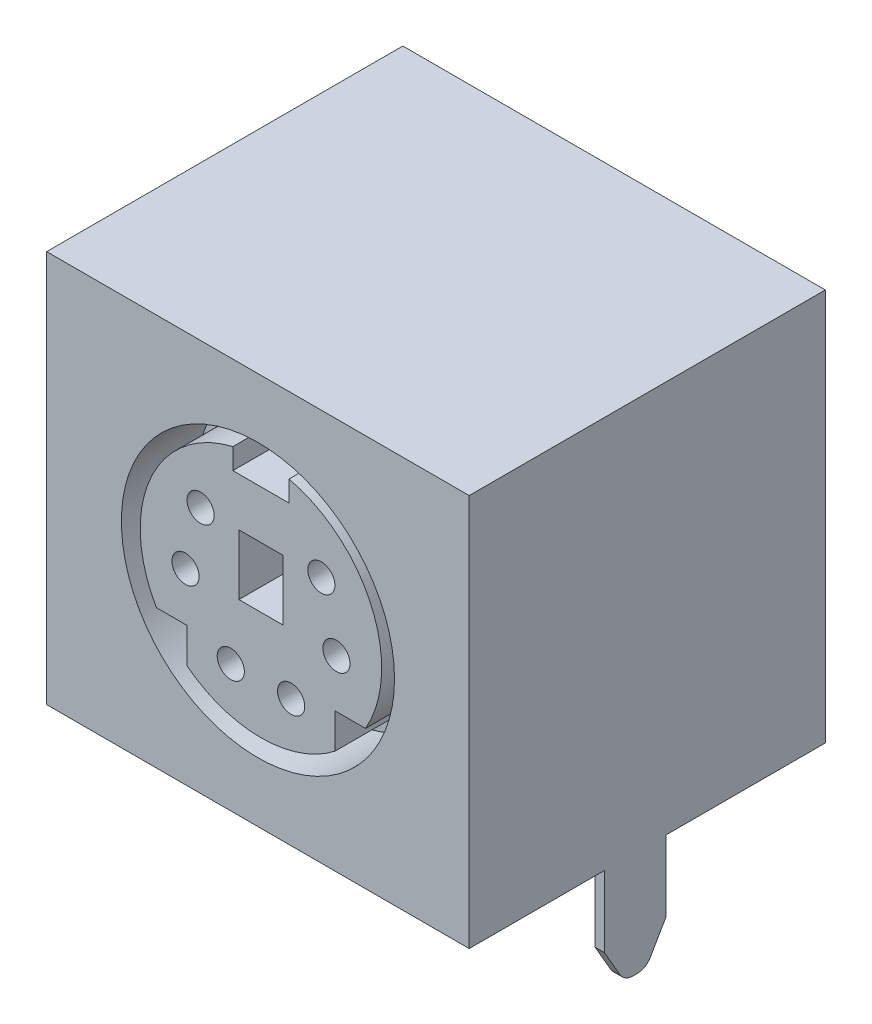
ISO-10303-21;
HEADER;
FILE_DESCRIPTION(('STEP AP214'),'2;1');
FILE_NAME('part.step','',(''),(''),'','','');
FILE_SCHEMA(('AUTOMOTIVE_DESIGN { 1 0 10303 214 1 1 1 1 }'));
ENDSEC;
DATA;
#1=APPLICATION_CONTEXT('core data for automotive mechanical design processes');
#2=APPLICATION_PROTOCOL_DEFINITION('international standard','automotive_design',2000,#1);
#3=PRODUCT_CONTEXT('',#1,'mechanical');
#4=PRODUCT('Part','Part','',(#3));
#5=PRODUCT_RELATED_PRODUCT_CATEGORY('part','',(#4));
#6=PRODUCT_DEFINITION_FORMATION('','',#4);
#7=PRODUCT_DEFINITION_CONTEXT('part definition',#1,'design');
#8=PRODUCT_DEFINITION('design','',#6,#7);
#9=PRODUCT_DEFINITION_SHAPE('','',#8);
#10=(LENGTH_UNIT() NAMED_UNIT(*) SI_UNIT(.MILLI.,.METRE.));
#11=(NAMED_UNIT(*) PLANE_ANGLE_UNIT() SI_UNIT($,.RADIAN.));
#12=(NAMED_UNIT(*) SI_UNIT($,.STERADIAN.) SOLID_ANGLE_UNIT());
#13=UNCERTAINTY_MEASURE_WITH_UNIT(LENGTH_MEASURE(1.E-05),#10,'distance_accuracy_value','');
#14=(GEOMETRIC_REPRESENTATION_CONTEXT(3) GLOBAL_UNCERTAINTY_ASSIGNED_CONTEXT((#13)) GLOBAL_UNIT_ASSIGNED_CONTEXT((#10,
#11,#12)) REPRESENTATION_CONTEXT('',''));
#15=CARTESIAN_POINT('',(0.,0.,0.));
#16=DIRECTION('',(0.,0.,1.));
#17=DIRECTION('',(1.,0.,0.));
#18=AXIS2_PLACEMENT_3D('',#15,#16,#17);
#19=CARTESIAN_POINT('',(4.699,-6.5,-4.51372371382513));
#20=DIRECTION('',(0.,1.,0.));
#21=DIRECTION('',(0.,0.,1.));
#22=AXIS2_PLACEMENT_3D('',#19,#20,#21);
#23=PLANE('',#22);
#24=DIRECTION('',(-1.,0.,0.));
#25=VECTOR('',#24,1.);
#26=CARTESIAN_POINT('',(4.699,-6.5,-6.99304060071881));
#27=LINE('',#26,#25);
#28=CARTESIAN_POINT('',(-1.699,-6.5,-6.99304060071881));
#29=VERTEX_POINT('',#28);
#30=CARTESIAN_POINT('',(-2.199,-6.5,-6.99304060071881));
#31=VERTEX_POINT('',#30);
#32=EDGE_CURVE('E586',#29,#31,#27,.T.);
#33=ORIENTED_EDGE('',*,*,#32,.F.);
#34=DIRECTION('',(0.,0.,-1.));
#35=VECTOR('',#34,1.);
#36=CARTESIAN_POINT('',(-1.699,-6.5,1.521575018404));
#37=LINE('',#36,#35);
#38=CARTESIAN_POINT('',(-1.699,-6.5,-4.51372371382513));
#39=VERTEX_POINT('',#38);
#40=EDGE_CURVE('E572',#39,#29,#37,.T.);
#41=ORIENTED_EDGE('',*,*,#40,.F.);
#42=DIRECTION('',(-1.,0.,0.));
#43=VECTOR('',#42,1.);
#44=CARTESIAN_POINT('',(4.699,-6.5,-4.51372371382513));
#45=LINE('',#44,#43);
#46=CARTESIAN_POINT('',(-2.199,-6.5,-4.51372371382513));
#47=VERTEX_POINT('',#46);
#48=EDGE_CURVE('E62',#39,#47,#45,.T.);
#49=ORIENTED_EDGE('',*,*,#48,.T.);
#50=DIRECTION('',(0.,0.,-1.));
#51=VECTOR('',#50,1.);
#52=CARTESIAN_POINT('',(-2.199,-6.5,1.521575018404));
#53=LINE('',#52,#51);
#54=EDGE_CURVE('E591',#47,#31,#53,.T.);
#55=ORIENTED_EDGE('',*,*,#54,.T.);
#56=EDGE_LOOP('',(#33,#41,#49,#55));
#57=FACE_BOUND('',#56,.T.);
#58=ADVANCED_FACE('F39',(#57),#23,.F.);
#59=CARTESIAN_POINT('',(4.699,-6.25,-6.99304060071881));
#60=DIRECTION('',(0.,0.,-1.));
#61=DIRECTION('',(-1.,0.,0.));
#62=AXIS2_PLACEMENT_3D('',#59,#60,#61);
#63=PLANE('',#62);
#64=DIRECTION('',(0.,1.,0.));
#65=VECTOR('',#64,1.);
#66=CARTESIAN_POINT('',(-1.699,-6.5,-6.99304060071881));
#67=LINE('',#66,#65);
#68=CARTESIAN_POINT('',(-1.699,-6.25,-6.99304060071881));
#69=VERTEX_POINT('',#68);
#70=EDGE_CURVE('E575',#29,#69,#67,.T.);
#71=ORIENTED_EDGE('',*,*,#70,.F.);
#72=ORIENTED_EDGE('',*,*,#32,.T.);
#73=DIRECTION('',(0.,-1.,0.));
#74=VECTOR('',#73,1.);
#75=CARTESIAN_POINT('',(-2.199,-6.5,-6.99304060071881));
#76=LINE('',#75,#74);
#77=CARTESIAN_POINT('',(-2.199,-6.25,-6.99304060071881));
#78=VERTEX_POINT('',#77);
#79=EDGE_CURVE('E1450',#78,#31,#76,.T.);
#80=ORIENTED_EDGE('',*,*,#79,.F.);
#81=DIRECTION('',(-1.,0.,0.));
#82=VECTOR('',#81,1.);
#83=CARTESIAN_POINT('',(4.699,-6.25,-6.99304060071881));
#84=LINE('',#83,#82);
#85=EDGE_CURVE('E588',#69,#78,#84,.T.);
#86=ORIENTED_EDGE('',*,*,#85,.F.);
#87=EDGE_LOOP('',(#71,#72,#80,#86));
#88=FACE_BOUND('',#87,.T.);
#89=ADVANCED_FACE('F584',(#88),#63,.T.);
#90=CARTESIAN_POINT('',(4.699,-6.25,-4.51372371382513));
#91=DIRECTION('',(0.,1.,0.));
#92=DIRECTION('',(0.,0.,1.));
#93=AXIS2_PLACEMENT_3D('',#90,#91,#92);
#94=PLANE('',#93);
#95=DIRECTION('',(0.,0.,1.));
#96=VECTOR('',#95,1.);
#97=CARTESIAN_POINT('',(-1.699,-6.25,-4.51372371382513));
#98=LINE('',#97,#96);
#99=CARTESIAN_POINT('',(-1.699,-6.25,-4.51372371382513));
#100=VERTEX_POINT('',#99);
#101=EDGE_CURVE('E1447',#69,#100,#98,.T.);
#102=ORIENTED_EDGE('',*,*,#101,.F.);
#103=ORIENTED_EDGE('',*,*,#85,.T.);
#104=DIRECTION('',(0.,0.,-1.));
#105=VECTOR('',#104,1.);
#106=CARTESIAN_POINT('',(-2.199,-6.25,-4.51372371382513));
#107=LINE('',#106,#105);
#108=CARTESIAN_POINT('',(-2.199,-6.25,-4.51372371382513));
#109=VERTEX_POINT('',#108);
#110=EDGE_CURVE('E1468',#109,#78,#107,.T.);
#111=ORIENTED_EDGE('',*,*,#110,.F.);
#112=DIRECTION('',(-1.,0.,0.));
#113=VECTOR('',#112,1.);
#114=CARTESIAN_POINT('',(4.699,-6.25,-4.51372371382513));
#115=LINE('',#114,#113);
#116=EDGE_CURVE('E646',#100,#109,#115,.T.);
#117=ORIENTED_EDGE('',*,*,#116,.F.);
#118=EDGE_LOOP('',(#102,#103,#111,#117));
#119=FACE_BOUND('',#118,.T.);
#120=ADVANCED_FACE('F1370',(#119),#94,.T.);
#121=CARTESIAN_POINT('',(4.699,-5.79266374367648,-4.51372371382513));
#122=DIRECTION('',(-1.,0.,0.));
#123=DIRECTION('',(0.,0.,1.));
#124=AXIS2_PLACEMENT_3D('',#121,#122,#123);
#125=CYLINDRICAL_SURFACE('',#124,0.457336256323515);
#126=CARTESIAN_POINT('',(-1.699,-5.79266374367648,-4.51372371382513));
#127=DIRECTION('',(-1.,0.,0.));
#128=DIRECTION('',(0.,-1.,0.));
#129=AXIS2_PLACEMENT_3D('',#126,#127,#128);
#130=CIRCLE('',#129,0.457336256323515);
#131=CARTESIAN_POINT('',(-1.699,-5.79266374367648,-4.05638745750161));
#132=VERTEX_POINT('',#131);
#133=EDGE_CURVE('E1445',#100,#132,#130,.T.);
#134=ORIENTED_EDGE('',*,*,#133,.F.);
#135=ORIENTED_EDGE('',*,*,#116,.T.);
#136=CARTESIAN_POINT('',(-2.199,-5.79266374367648,-4.51372371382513));
#137=DIRECTION('',(1.,0.,0.));
#138=DIRECTION('',(0.,0.,-1.));
#139=AXIS2_PLACEMENT_3D('',#136,#137,#138);
#140=CIRCLE('',#139,0.457336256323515);
#141=CARTESIAN_POINT('',(-2.199,-5.79266374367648,-4.05638745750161));
#142=VERTEX_POINT('',#141);
#143=EDGE_CURVE('E1466',#142,#109,#140,.T.);
#144=ORIENTED_EDGE('',*,*,#143,.F.);
#145=DIRECTION('',(-1.,0.,0.));
#146=VECTOR('',#145,1.);
#147=CARTESIAN_POINT('',(4.699,-5.79266374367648,-4.05638745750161));
#148=LINE('',#147,#146);
#149=EDGE_CURVE('E673',#132,#142,#148,.T.);
#150=ORIENTED_EDGE('',*,*,#149,.F.);
#151=EDGE_LOOP('',(#134,#135,#144,#150));
#152=FACE_BOUND('',#151,.T.);
#153=ADVANCED_FACE('F1538',(#152),#125,.F.);
#154=CARTESIAN_POINT('',(4.699,-4.54236197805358,-4.05638745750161));
#155=DIRECTION('',(0.,0.,-1.));
#156=DIRECTION('',(-1.,0.,0.));
#157=AXIS2_PLACEMENT_3D('',#154,#155,#156);
#158=PLANE('',#157);
#159=DIRECTION('',(0.,1.,0.));
#160=VECTOR('',#159,1.);
#161=CARTESIAN_POINT('',(-1.699,-4.54236197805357,-4.05638745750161));
#162=LINE('',#161,#160);
#163=CARTESIAN_POINT('',(-1.699,-4.54236197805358,-4.05638745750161));
#164=VERTEX_POINT('',#163);
#165=EDGE_CURVE('E1443',#132,#164,#162,.T.);
#166=ORIENTED_EDGE('',*,*,#165,.F.);
#167=ORIENTED_EDGE('',*,*,#149,.T.);
#168=DIRECTION('',(0.,-1.,0.));
#169=VECTOR('',#168,1.);
#170=CARTESIAN_POINT('',(-2.199,-4.54236197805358,-4.05638745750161));
#171=LINE('',#170,#169);
#172=CARTESIAN_POINT('',(-2.199,-4.54236197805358,-4.05638745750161));
#173=VERTEX_POINT('',#172);
#174=EDGE_CURVE('E1464',#173,#142,#171,.T.);
#175=ORIENTED_EDGE('',*,*,#174,.F.);
#176=DIRECTION('',(-1.,0.,0.));
#177=VECTOR('',#176,1.);
#178=CARTESIAN_POINT('',(4.699,-4.54236197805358,-4.05638745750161));
#179=LINE('',#178,#177);
#180=EDGE_CURVE('E700',#164,#173,#179,.T.);
#181=ORIENTED_EDGE('',*,*,#180,.F.);
#182=EDGE_LOOP('',(#166,#167,#175,#181));
#183=FACE_BOUND('',#182,.T.);
#184=ADVANCED_FACE('F1534',(#183),#158,.T.);
#185=CARTESIAN_POINT('',(4.699,-4.54236197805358,-3.80638745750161));
#186=DIRECTION('',(0.,0.,-1.));
#187=DIRECTION('',(-1.,0.,0.));
#188=AXIS2_PLACEMENT_3D('',#185,#186,#187);
#189=PLANE('',#188);
#190=DIRECTION('',(-1.,0.,0.));
#191=VECTOR('',#190,1.);
#192=CARTESIAN_POINT('',(4.699,-5.79266374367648,-3.80638745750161));
#193=LINE('',#192,#191);
#194=CARTESIAN_POINT('',(-1.699,-5.79266374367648,-3.80638745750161));
#195=VERTEX_POINT('',#194);
#196=CARTESIAN_POINT('',(-2.199,-5.79266374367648,-3.80638745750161));
#197=VERTEX_POINT('',#196);
#198=EDGE_CURVE('E754',#195,#197,#193,.T.);
#199=ORIENTED_EDGE('',*,*,#198,.F.);
#200=DIRECTION('',(0.,1.,0.));
#201=VECTOR('',#200,1.);
#202=CARTESIAN_POINT('',(-1.699,-4.54236197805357,-3.80638745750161));
#203=LINE('',#202,#201);
#204=CARTESIAN_POINT('',(-1.699,-4.54236197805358,-3.80638745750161));
#205=VERTEX_POINT('',#204);
#206=EDGE_CURVE('E1441',#195,#205,#203,.T.);
#207=ORIENTED_EDGE('',*,*,#206,.T.);
#208=DIRECTION('',(-1.,0.,0.));
#209=VECTOR('',#208,1.);
#210=CARTESIAN_POINT('',(4.699,-4.54236197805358,-3.80638745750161));
#211=LINE('',#210,#209);
#212=CARTESIAN_POINT('',(-2.199,-4.54236197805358,-3.80638745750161));
#213=VERTEX_POINT('',#212);
#214=EDGE_CURVE('E727',#205,#213,#211,.T.);
#215=ORIENTED_EDGE('',*,*,#214,.T.);
#216=DIRECTION('',(0.,-1.,0.));
#217=VECTOR('',#216,1.);
#218=CARTESIAN_POINT('',(-2.199,-4.54236197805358,-3.80638745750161));
#219=LINE('',#218,#217);
#220=EDGE_CURVE('E1462',#213,#197,#219,.T.);
#221=ORIENTED_EDGE('',*,*,#220,.T.);
#222=EDGE_LOOP('',(#199,#207,#215,#221));
#223=FACE_BOUND('',#222,.T.);
#224=ADVANCED_FACE('F1529',(#223),#189,.F.);
#225=CARTESIAN_POINT('',(4.699,-5.79266374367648,-4.51372371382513));
#226=DIRECTION('',(-1.,0.,0.));
#227=DIRECTION('',(0.,0.,1.));
#228=AXIS2_PLACEMENT_3D('',#225,#226,#227);
#229=CYLINDRICAL_SURFACE('',#228,0.707336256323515);
#230=ORIENTED_EDGE('',*,*,#48,.F.);
#231=CARTESIAN_POINT('',(-1.699,-5.79266374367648,-4.51372371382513));
#232=DIRECTION('',(-1.,0.,0.));
#233=DIRECTION('',(0.,-1.,0.));
#234=AXIS2_PLACEMENT_3D('',#231,#232,#233);
#235=CIRCLE('',#234,0.707336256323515);
#236=EDGE_CURVE('E578',#39,#195,#235,.T.);
#237=ORIENTED_EDGE('',*,*,#236,.T.);
#238=ORIENTED_EDGE('',*,*,#198,.T.);
#239=CARTESIAN_POINT('',(-2.199,-5.79266374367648,-4.51372371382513));
#240=DIRECTION('',(1.,0.,0.));
#241=DIRECTION('',(0.,0.,-1.));
#242=AXIS2_PLACEMENT_3D('',#239,#240,#241);
#243=CIRCLE('',#242,0.707336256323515);
#244=EDGE_CURVE('E1460',#197,#47,#243,.T.);
#245=ORIENTED_EDGE('',*,*,#244,.T.);
#246=EDGE_LOOP('',(#230,#237,#238,#245));
#247=FACE_BOUND('',#246,.T.);
#248=ADVANCED_FACE('F1376',(#247),#229,.T.);
#249=CARTESIAN_POINT('',(-2.949,-6.5,-6.99304060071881));
#250=VERTEX_POINT('',#249);
#251=CARTESIAN_POINT('',(-3.449,-6.5,-6.99304060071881));
#252=VERTEX_POINT('',#251);
#253=EDGE_CURVE('E593',#250,#252,#27,.T.);
#254=ORIENTED_EDGE('',*,*,#253,.F.);
#255=DIRECTION('',(0.,0.,-1.));
#256=VECTOR('',#255,1.);
#257=CARTESIAN_POINT('',(-2.949,-6.5,1.521575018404));
#258=LINE('',#257,#256);
#259=CARTESIAN_POINT('',(-2.949,-6.5,-4.51372371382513));
#260=VERTEX_POINT('',#259);
#261=EDGE_CURVE('E1455',#260,#250,#258,.T.);
#262=ORIENTED_EDGE('',*,*,#261,.F.);
#263=CARTESIAN_POINT('',(-3.449,-6.5,-4.51372371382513));
#264=VERTEX_POINT('',#263);
#265=EDGE_CURVE('E789',#260,#264,#45,.T.);
#266=ORIENTED_EDGE('',*,*,#265,.T.);
#267=DIRECTION('',(0.,0.,-1.));
#268=VECTOR('',#267,1.);
#269=CARTESIAN_POINT('',(-3.449,-6.5,1.521575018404));
#270=LINE('',#269,#268);
#271=EDGE_CURVE('E906',#264,#252,#270,.T.);
#272=ORIENTED_EDGE('',*,*,#271,.T.);
#273=EDGE_LOOP('',(#254,#262,#266,#272));
#274=FACE_BOUND('',#273,.T.);
#275=ADVANCED_FACE('F1365',(#274),#23,.F.);
#276=DIRECTION('',(0.,1.,0.));
#277=VECTOR('',#276,1.);
#278=CARTESIAN_POINT('',(-2.949,-6.5,-6.99304060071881));
#279=LINE('',#278,#277);
#280=CARTESIAN_POINT('',(-2.949,-6.25,-6.99304060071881));
#281=VERTEX_POINT('',#280);
#282=EDGE_CURVE('E1449',#250,#281,#279,.T.);
#283=ORIENTED_EDGE('',*,*,#282,.F.);
#284=ORIENTED_EDGE('',*,*,#253,.T.);
#285=DIRECTION('',(0.,-1.,0.));
#286=VECTOR('',#285,1.);
#287=CARTESIAN_POINT('',(-3.449,-6.5,-6.99304060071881));
#288=LINE('',#287,#286);
#289=CARTESIAN_POINT('',(-3.449,-6.25,-6.99304060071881));
#290=VERTEX_POINT('',#289);
#291=EDGE_CURVE('E901',#290,#252,#288,.T.);
#292=ORIENTED_EDGE('',*,*,#291,.F.);
#293=EDGE_CURVE('E629',#281,#290,#84,.T.);
#294=ORIENTED_EDGE('',*,*,#293,.F.);
#295=EDGE_LOOP('',(#283,#284,#292,#294));
#296=FACE_BOUND('',#295,.T.);
#297=ADVANCED_FACE('F1372',(#296),#63,.T.);
#298=DIRECTION('',(0.,0.,1.));
#299=VECTOR('',#298,1.);
#300=CARTESIAN_POINT('',(-2.949,-6.25,-4.51372371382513));
#301=LINE('',#300,#299);
#302=CARTESIAN_POINT('',(-2.949,-6.25,-4.51372371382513));
#303=VERTEX_POINT('',#302);
#304=EDGE_CURVE('E1478',#281,#303,#301,.T.);
#305=ORIENTED_EDGE('',*,*,#304,.F.);
#306=ORIENTED_EDGE('',*,*,#293,.T.);
#307=DIRECTION('',(0.,0.,-1.));
#308=VECTOR('',#307,1.);
#309=CARTESIAN_POINT('',(-3.449,-6.25,-4.51372371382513));
#310=LINE('',#309,#308);
#311=CARTESIAN_POINT('',(-3.449,-6.25,-4.51372371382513));
#312=VERTEX_POINT('',#311);
#313=EDGE_CURVE('E921',#312,#290,#310,.T.);
#314=ORIENTED_EDGE('',*,*,#313,.F.);
#315=EDGE_CURVE('E654',#303,#312,#115,.T.);
#316=ORIENTED_EDGE('',*,*,#315,.F.);
#317=EDGE_LOOP('',(#305,#306,#314,#316));
#318=FACE_BOUND('',#317,.T.);
#319=ADVANCED_FACE('F1541',(#318),#94,.T.);
#320=CARTESIAN_POINT('',(-2.949,-5.79266374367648,-4.51372371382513));
#321=DIRECTION('',(-1.,0.,0.));
#322=DIRECTION('',(0.,0.,1.));
#323=AXIS2_PLACEMENT_3D('',#320,#321,#322);
#324=CIRCLE('',#323,0.457336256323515);
#325=CARTESIAN_POINT('',(-2.949,-5.79266374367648,-4.05638745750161));
#326=VERTEX_POINT('',#325);
#327=EDGE_CURVE('E1476',#303,#326,#324,.T.);
#328=ORIENTED_EDGE('',*,*,#327,.F.);
#329=ORIENTED_EDGE('',*,*,#315,.T.);
#330=CARTESIAN_POINT('',(-3.449,-5.79266374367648,-4.51372371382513));
#331=DIRECTION('',(1.,0.,0.));
#332=DIRECTION('',(0.,1.,0.));
#333=AXIS2_PLACEMENT_3D('',#330,#331,#332);
#334=CIRCLE('',#333,0.457336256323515);
#335=CARTESIAN_POINT('',(-3.449,-5.79266374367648,-4.05638745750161));
#336=VERTEX_POINT('',#335);
#337=EDGE_CURVE('E919',#336,#312,#334,.T.);
#338=ORIENTED_EDGE('',*,*,#337,.F.);
#339=EDGE_CURVE('E681',#326,#336,#148,.T.);
#340=ORIENTED_EDGE('',*,*,#339,.F.);
#341=EDGE_LOOP('',(#328,#329,#338,#340));
#342=FACE_BOUND('',#341,.T.);
#343=ADVANCED_FACE('F1546',(#342),#125,.F.);
#344=DIRECTION('',(0.,1.,0.));
#345=VECTOR('',#344,1.);
#346=CARTESIAN_POINT('',(-2.949,-4.54236197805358,-4.05638745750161));
#347=LINE('',#346,#345);
#348=CARTESIAN_POINT('',(-2.949,-4.54236197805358,-4.05638745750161));
#349=VERTEX_POINT('',#348);
#350=EDGE_CURVE('E1474',#326,#349,#347,.T.);
#351=ORIENTED_EDGE('',*,*,#350,.F.);
#352=ORIENTED_EDGE('',*,*,#339,.T.);
#353=DIRECTION('',(0.,-1.,0.));
#354=VECTOR('',#353,1.);
#355=CARTESIAN_POINT('',(-3.449,-4.54236197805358,-4.05638745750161));
#356=LINE('',#355,#354);
#357=CARTESIAN_POINT('',(-3.449,-4.54236197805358,-4.05638745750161));
#358=VERTEX_POINT('',#357);
#359=EDGE_CURVE('E917',#358,#336,#356,.T.);
#360=ORIENTED_EDGE('',*,*,#359,.F.);
#361=EDGE_CURVE('E708',#349,#358,#179,.T.);
#362=ORIENTED_EDGE('',*,*,#361,.F.);
#363=EDGE_LOOP('',(#351,#352,#360,#362));
#364=FACE_BOUND('',#363,.T.);
#365=ADVANCED_FACE('F1633',(#364),#158,.T.);
#366=CARTESIAN_POINT('',(-2.949,-5.79266374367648,-3.80638745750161));
#367=VERTEX_POINT('',#366);
#368=CARTESIAN_POINT('',(-3.449,-5.79266374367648,-3.80638745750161));
#369=VERTEX_POINT('',#368);
#370=EDGE_CURVE('E763',#367,#369,#193,.T.);
#371=ORIENTED_EDGE('',*,*,#370,.F.);
#372=DIRECTION('',(0.,1.,0.));
#373=VECTOR('',#372,1.);
#374=CARTESIAN_POINT('',(-2.949,-4.54236197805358,-3.80638745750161));
#375=LINE('',#374,#373);
#376=CARTESIAN_POINT('',(-2.949,-4.54236197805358,-3.80638745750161));
#377=VERTEX_POINT('',#376);
#378=EDGE_CURVE('E1472',#367,#377,#375,.T.);
#379=ORIENTED_EDGE('',*,*,#378,.T.);
#380=CARTESIAN_POINT('',(-3.449,-4.54236197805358,-3.80638745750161));
#381=VERTEX_POINT('',#380);
#382=EDGE_CURVE('E735',#377,#381,#211,.T.);
#383=ORIENTED_EDGE('',*,*,#382,.T.);
#384=DIRECTION('',(0.,-1.,0.));
#385=VECTOR('',#384,1.);
#386=CARTESIAN_POINT('',(-3.449,-4.54236197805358,-3.80638745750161));
#387=LINE('',#386,#385);
#388=EDGE_CURVE('E915',#381,#369,#387,.T.);
#389=ORIENTED_EDGE('',*,*,#388,.T.);
#390=EDGE_LOOP('',(#371,#379,#383,#389));
#391=FACE_BOUND('',#390,.T.);
#392=ADVANCED_FACE('F1420',(#391),#189,.F.);
#393=ORIENTED_EDGE('',*,*,#265,.F.);
#394=CARTESIAN_POINT('',(-2.949,-5.79266374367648,-4.51372371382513));
#395=DIRECTION('',(-1.,0.,0.));
#396=DIRECTION('',(0.,0.,1.));
#397=AXIS2_PLACEMENT_3D('',#394,#395,#396);
#398=CIRCLE('',#397,0.707336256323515);
#399=EDGE_CURVE('E1470',#260,#367,#398,.T.);
#400=ORIENTED_EDGE('',*,*,#399,.T.);
#401=ORIENTED_EDGE('',*,*,#370,.T.);
#402=CARTESIAN_POINT('',(-3.449,-5.79266374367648,-4.51372371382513));
#403=DIRECTION('',(1.,0.,0.));
#404=DIRECTION('',(0.,1.,0.));
#405=AXIS2_PLACEMENT_3D('',#402,#403,#404);
#406=CIRCLE('',#405,0.707336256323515);
#407=EDGE_CURVE('E913',#369,#264,#406,.T.);
#408=ORIENTED_EDGE('',*,*,#407,.T.);
#409=EDGE_LOOP('',(#393,#400,#401,#408));
#410=FACE_BOUND('',#409,.T.);
#411=ADVANCED_FACE('F1411',(#410),#229,.T.);
#412=CARTESIAN_POINT('',(2.199,-6.5,-4.51372371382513));
#413=VERTEX_POINT('',#412);
#414=CARTESIAN_POINT('',(1.699,-6.5,-4.51372371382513));
#415=VERTEX_POINT('',#414);
#416=EDGE_CURVE('E786',#413,#415,#45,.T.);
#417=ORIENTED_EDGE('',*,*,#416,.T.);
#418=DIRECTION('',(0.,0.,-1.));
#419=VECTOR('',#418,1.);
#420=CARTESIAN_POINT('',(1.699,-6.5,1.521575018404));
#421=LINE('',#420,#419);
#422=CARTESIAN_POINT('',(1.699,-6.5,-6.99304060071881));
#423=VERTEX_POINT('',#422);
#424=EDGE_CURVE('E54',#415,#423,#421,.T.);
#425=ORIENTED_EDGE('',*,*,#424,.T.);
#426=CARTESIAN_POINT('',(2.199,-6.5,-6.99304060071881));
#427=VERTEX_POINT('',#426);
#428=EDGE_CURVE('E592',#427,#423,#27,.T.);
#429=ORIENTED_EDGE('',*,*,#428,.F.);
#430=DIRECTION('',(0.,0.,-1.));
#431=VECTOR('',#430,1.);
#432=CARTESIAN_POINT('',(2.199,-6.5,1.521575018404));
#433=LINE('',#432,#431);
#434=EDGE_CURVE('E1424',#413,#427,#433,.T.);
#435=ORIENTED_EDGE('',*,*,#434,.F.);
#436=EDGE_LOOP('',(#417,#425,#429,#435));
#437=FACE_BOUND('',#436,.T.);
#438=ADVANCED_FACE('F1377',(#437),#23,.F.);
#439=DIRECTION('',(0.,-1.,0.));
#440=VECTOR('',#439,1.);
#441=CARTESIAN_POINT('',(1.699,-6.5,-6.99304060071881));
#442=LINE('',#441,#440);
#443=CARTESIAN_POINT('',(1.699,-6.25,-6.99304060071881));
#444=VERTEX_POINT('',#443);
#445=EDGE_CURVE('E589',#444,#423,#442,.T.);
#446=ORIENTED_EDGE('',*,*,#445,.F.);
#447=CARTESIAN_POINT('',(2.199,-6.25,-6.99304060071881));
#448=VERTEX_POINT('',#447);
#449=EDGE_CURVE('E626',#448,#444,#84,.T.);
#450=ORIENTED_EDGE('',*,*,#449,.F.);
#451=DIRECTION('',(0.,1.,0.));
#452=VECTOR('',#451,1.);
#453=CARTESIAN_POINT('',(2.199,-6.5,-6.99304060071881));
#454=LINE('',#453,#452);
#455=EDGE_CURVE('E1481',#427,#448,#454,.T.);
#456=ORIENTED_EDGE('',*,*,#455,.F.);
#457=ORIENTED_EDGE('',*,*,#428,.T.);
#458=EDGE_LOOP('',(#446,#450,#456,#457));
#459=FACE_BOUND('',#458,.T.);
#460=ADVANCED_FACE('F1408',(#459),#63,.T.);
#461=DIRECTION('',(0.,0.,-1.));
#462=VECTOR('',#461,1.);
#463=CARTESIAN_POINT('',(1.699,-6.25,-4.51372371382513));
#464=LINE('',#463,#462);
#465=CARTESIAN_POINT('',(1.699,-6.25,-4.51372371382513));
#466=VERTEX_POINT('',#465);
#467=EDGE_CURVE('E1438',#466,#444,#464,.T.);
#468=ORIENTED_EDGE('',*,*,#467,.F.);
#469=CARTESIAN_POINT('',(2.199,-6.25,-4.51372371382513));
#470=VERTEX_POINT('',#469);
#471=EDGE_CURVE('E651',#470,#466,#115,.T.);
#472=ORIENTED_EDGE('',*,*,#471,.F.);
#473=DIRECTION('',(0.,0.,1.));
#474=VECTOR('',#473,1.);
#475=CARTESIAN_POINT('',(2.199,-6.25,-4.51372371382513));
#476=LINE('',#475,#474);
#477=EDGE_CURVE('E898',#448,#470,#476,.T.);
#478=ORIENTED_EDGE('',*,*,#477,.F.);
#479=ORIENTED_EDGE('',*,*,#449,.T.);
#480=EDGE_LOOP('',(#468,#472,#478,#479));
#481=FACE_BOUND('',#480,.T.);
#482=ADVANCED_FACE('F1418',(#481),#94,.T.);
#483=CARTESIAN_POINT('',(1.699,-5.79266374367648,-4.51372371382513));
#484=DIRECTION('',(1.,0.,0.));
#485=DIRECTION('',(0.,0.,-1.));
#486=AXIS2_PLACEMENT_3D('',#483,#484,#485);
#487=CIRCLE('',#486,0.457336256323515);
#488=CARTESIAN_POINT('',(1.699,-5.79266374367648,-4.05638745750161));
#489=VERTEX_POINT('',#488);
#490=EDGE_CURVE('E1436',#489,#466,#487,.T.);
#491=ORIENTED_EDGE('',*,*,#490,.F.);
#492=CARTESIAN_POINT('',(2.199,-5.79266374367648,-4.05638745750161));
#493=VERTEX_POINT('',#492);
#494=EDGE_CURVE('E678',#493,#489,#148,.T.);
#495=ORIENTED_EDGE('',*,*,#494,.F.);
#496=CARTESIAN_POINT('',(2.199,-5.79266374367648,-4.51372371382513));
#497=DIRECTION('',(-1.,0.,0.));
#498=DIRECTION('',(0.,0.,1.));
#499=AXIS2_PLACEMENT_3D('',#496,#497,#498);
#500=CIRCLE('',#499,0.457336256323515);
#501=EDGE_CURVE('E896',#470,#493,#500,.T.);
#502=ORIENTED_EDGE('',*,*,#501,.F.);
#503=ORIENTED_EDGE('',*,*,#471,.T.);
#504=EDGE_LOOP('',(#491,#495,#502,#503));
#505=FACE_BOUND('',#504,.T.);
#506=ADVANCED_FACE('F1562',(#505),#125,.F.);
#507=DIRECTION('',(0.,-1.,0.));
#508=VECTOR('',#507,1.);
#509=CARTESIAN_POINT('',(1.699,-4.54236197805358,-4.05638745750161));
#510=LINE('',#509,#508);
#511=CARTESIAN_POINT('',(1.699,-4.54236197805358,-4.05638745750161));
#512=VERTEX_POINT('',#511);
#513=EDGE_CURVE('E1430',#512,#489,#510,.T.);
#514=ORIENTED_EDGE('',*,*,#513,.F.);
#515=CARTESIAN_POINT('',(2.199,-4.54236197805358,-4.05638745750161));
#516=VERTEX_POINT('',#515);
#517=EDGE_CURVE('E705',#516,#512,#179,.T.);
#518=ORIENTED_EDGE('',*,*,#517,.F.);
#519=DIRECTION('',(0.,1.,0.));
#520=VECTOR('',#519,1.);
#521=CARTESIAN_POINT('',(2.199,-4.54236197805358,-4.05638745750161));
#522=LINE('',#521,#520);
#523=EDGE_CURVE('E894',#493,#516,#522,.T.);
#524=ORIENTED_EDGE('',*,*,#523,.F.);
#525=ORIENTED_EDGE('',*,*,#494,.T.);
#526=EDGE_LOOP('',(#514,#518,#524,#525));
#527=FACE_BOUND('',#526,.T.);
#528=ADVANCED_FACE('F1568',(#527),#158,.T.);
#529=CARTESIAN_POINT('',(2.199,-4.54236197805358,-3.80638745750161));
#530=VERTEX_POINT('',#529);
#531=CARTESIAN_POINT('',(1.699,-4.54236197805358,-3.80638745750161));
#532=VERTEX_POINT('',#531);
#533=EDGE_CURVE('E732',#530,#532,#211,.T.);
#534=ORIENTED_EDGE('',*,*,#533,.T.);
#535=DIRECTION('',(0.,-1.,0.));
#536=VECTOR('',#535,1.);
#537=CARTESIAN_POINT('',(1.699,-4.54236197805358,-3.80638745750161));
#538=LINE('',#537,#536);
#539=CARTESIAN_POINT('',(1.699,-5.79266374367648,-3.80638745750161));
#540=VERTEX_POINT('',#539);
#541=EDGE_CURVE('E1428',#532,#540,#538,.T.);
#542=ORIENTED_EDGE('',*,*,#541,.T.);
#543=CARTESIAN_POINT('',(2.199,-5.79266374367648,-3.80638745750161));
#544=VERTEX_POINT('',#543);
#545=EDGE_CURVE('E760',#544,#540,#193,.T.);
#546=ORIENTED_EDGE('',*,*,#545,.F.);
#547=DIRECTION('',(0.,1.,0.));
#548=VECTOR('',#547,1.);
#549=CARTESIAN_POINT('',(2.199,-4.54236197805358,-3.80638745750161));
#550=LINE('',#549,#548);
#551=EDGE_CURVE('E886',#544,#530,#550,.T.);
#552=ORIENTED_EDGE('',*,*,#551,.T.);
#553=EDGE_LOOP('',(#534,#542,#546,#552));
#554=FACE_BOUND('',#553,.T.);
#555=ADVANCED_FACE('F1409',(#554),#189,.F.);
#556=ORIENTED_EDGE('',*,*,#545,.T.);
#557=CARTESIAN_POINT('',(1.699,-5.79266374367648,-4.51372371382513));
#558=DIRECTION('',(1.,0.,0.));
#559=DIRECTION('',(0.,0.,-1.));
#560=AXIS2_PLACEMENT_3D('',#557,#558,#559);
#561=CIRCLE('',#560,0.707336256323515);
#562=EDGE_CURVE('E1426',#540,#415,#561,.T.);
#563=ORIENTED_EDGE('',*,*,#562,.T.);
#564=ORIENTED_EDGE('',*,*,#416,.F.);
#565=CARTESIAN_POINT('',(2.199,-5.79266374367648,-4.51372371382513));
#566=DIRECTION('',(-1.,0.,0.));
#567=DIRECTION('',(0.,0.,1.));
#568=AXIS2_PLACEMENT_3D('',#565,#566,#567);
#569=CIRCLE('',#568,0.707336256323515);
#570=EDGE_CURVE('E882',#413,#544,#569,.T.);
#571=ORIENTED_EDGE('',*,*,#570,.T.);
#572=EDGE_LOOP('',(#556,#563,#564,#571));
#573=FACE_BOUND('',#572,.T.);
#574=ADVANCED_FACE('F1401',(#573),#229,.T.);
#575=CARTESIAN_POINT('',(-4.199,-6.5,-6.99304060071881));
#576=VERTEX_POINT('',#575);
#577=CARTESIAN_POINT('',(-4.699,-6.5,-6.99304060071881));
#578=VERTEX_POINT('',#577);
#579=EDGE_CURVE('E598',#576,#578,#27,.T.);
#580=ORIENTED_EDGE('',*,*,#579,.F.);
#581=DIRECTION('',(0.,0.,-1.));
#582=VECTOR('',#581,1.);
#583=CARTESIAN_POINT('',(-4.199,-6.5,1.521575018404));
#584=LINE('',#583,#582);
#585=CARTESIAN_POINT('',(-4.199,-6.5,-4.51372371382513));
#586=VERTEX_POINT('',#585);
#587=EDGE_CURVE('E908',#586,#576,#584,.T.);
#588=ORIENTED_EDGE('',*,*,#587,.F.);
#589=CARTESIAN_POINT('',(-4.699,-6.5,-4.51372371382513));
#590=VERTEX_POINT('',#589);
#591=EDGE_CURVE('E787',#586,#590,#45,.T.);
#592=ORIENTED_EDGE('',*,*,#591,.T.);
#593=DIRECTION('',(0.,0.,-1.));
#594=VECTOR('',#593,1.);
#595=CARTESIAN_POINT('',(-4.699,-6.5,-4.51372371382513));
#596=LINE('',#595,#594);
#597=EDGE_CURVE('E807',#590,#578,#596,.T.);
#598=ORIENTED_EDGE('',*,*,#597,.T.);
#599=EDGE_LOOP('',(#580,#588,#592,#598));
#600=FACE_BOUND('',#599,.T.);
#601=ADVANCED_FACE('F1392',(#600),#23,.F.);
#602=DIRECTION('',(0.,1.,0.));
#603=VECTOR('',#602,1.);
#604=CARTESIAN_POINT('',(-4.199,-6.5,-6.99304060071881));
#605=LINE('',#604,#603);
#606=CARTESIAN_POINT('',(-4.199,-6.25,-6.99304060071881));
#607=VERTEX_POINT('',#606);
#608=EDGE_CURVE('E900',#576,#607,#605,.T.);
#609=ORIENTED_EDGE('',*,*,#608,.F.);
#610=ORIENTED_EDGE('',*,*,#579,.T.);
#611=DIRECTION('',(0.,-1.,0.));
#612=VECTOR('',#611,1.);
#613=CARTESIAN_POINT('',(-4.699,-6.25,-6.99304060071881));
#614=LINE('',#613,#612);
#615=CARTESIAN_POINT('',(-4.699,-6.25,-6.99304060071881));
#616=VERTEX_POINT('',#615);
#617=EDGE_CURVE('E809',#616,#578,#614,.T.);
#618=ORIENTED_EDGE('',*,*,#617,.F.);
#619=EDGE_CURVE('E627',#607,#616,#84,.T.);
#620=ORIENTED_EDGE('',*,*,#619,.F.);
#621=EDGE_LOOP('',(#609,#610,#618,#620));
#622=FACE_BOUND('',#621,.T.);
#623=ADVANCED_FACE('F1397',(#622),#63,.T.);
#624=DIRECTION('',(0.,0.,1.));
#625=VECTOR('',#624,1.);
#626=CARTESIAN_POINT('',(-4.199,-6.25,-4.51372371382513));
#627=LINE('',#626,#625);
#628=CARTESIAN_POINT('',(-4.199,-6.25,-4.51372371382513));
#629=VERTEX_POINT('',#628);
#630=EDGE_CURVE('E931',#607,#629,#627,.T.);
#631=ORIENTED_EDGE('',*,*,#630,.F.);
#632=ORIENTED_EDGE('',*,*,#619,.T.);
#633=DIRECTION('',(0.,0.,-1.));
#634=VECTOR('',#633,1.);
#635=CARTESIAN_POINT('',(-4.699,-6.25,-4.51372371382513));
#636=LINE('',#635,#634);
#637=CARTESIAN_POINT('',(-4.699,-6.25,-4.51372371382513));
#638=VERTEX_POINT('',#637);
#639=EDGE_CURVE('E813',#638,#616,#636,.T.);
#640=ORIENTED_EDGE('',*,*,#639,.F.);
#641=EDGE_CURVE('E652',#629,#638,#115,.T.);
#642=ORIENTED_EDGE('',*,*,#641,.F.);
#643=EDGE_LOOP('',(#631,#632,#640,#642));
#644=FACE_BOUND('',#643,.T.);
#645=ADVANCED_FACE('F1407',(#644),#94,.T.);
#646=CARTESIAN_POINT('',(-4.199,-5.79266374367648,-4.51372371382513));
#647=DIRECTION('',(-1.,0.,0.));
#648=DIRECTION('',(0.,0.,1.));
#649=AXIS2_PLACEMENT_3D('',#646,#647,#648);
#650=CIRCLE('',#649,0.457336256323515);
#651=CARTESIAN_POINT('',(-4.199,-5.79266374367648,-4.05638745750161));
#652=VERTEX_POINT('',#651);
#653=EDGE_CURVE('E929',#629,#652,#650,.T.);
#654=ORIENTED_EDGE('',*,*,#653,.F.);
#655=ORIENTED_EDGE('',*,*,#641,.T.);
#656=CARTESIAN_POINT('',(-4.699,-5.79266374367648,-4.51372371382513));
#657=DIRECTION('',(1.,0.,0.));
#658=DIRECTION('',(0.,0.,-1.));
#659=AXIS2_PLACEMENT_3D('',#656,#657,#658);
#660=CIRCLE('',#659,0.457336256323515);
#661=CARTESIAN_POINT('',(-4.699,-5.79266374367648,-4.05638745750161));
#662=VERTEX_POINT('',#661);
#663=EDGE_CURVE('E816',#662,#638,#660,.T.);
#664=ORIENTED_EDGE('',*,*,#663,.F.);
#665=EDGE_CURVE('E679',#652,#662,#148,.T.);
#666=ORIENTED_EDGE('',*,*,#665,.F.);
#667=EDGE_LOOP('',(#654,#655,#664,#666));
#668=FACE_BOUND('',#667,.T.);
#669=ADVANCED_FACE('F1556',(#668),#125,.F.);
#670=DIRECTION('',(0.,1.,0.));
#671=VECTOR('',#670,1.);
#672=CARTESIAN_POINT('',(-4.199,-4.54236197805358,-4.05638745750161));
#673=LINE('',#672,#671);
#674=CARTESIAN_POINT('',(-4.199,-4.54236197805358,-4.05638745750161));
#675=VERTEX_POINT('',#674);
#676=EDGE_CURVE('E927',#652,#675,#673,.T.);
#677=ORIENTED_EDGE('',*,*,#676,.F.);
#678=ORIENTED_EDGE('',*,*,#665,.T.);
#679=DIRECTION('',(0.,1.,0.));
#680=VECTOR('',#679,1.);
#681=CARTESIAN_POINT('',(-4.699,-4.54236197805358,-4.05638745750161));
#682=LINE('',#681,#680);
#683=CARTESIAN_POINT('',(-4.699,-4.54236197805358,-4.05638745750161));
#684=VERTEX_POINT('',#683);
#685=EDGE_CURVE('E819',#684,#662,#682,.F.);
#686=ORIENTED_EDGE('',*,*,#685,.F.);
#687=EDGE_CURVE('E706',#675,#684,#179,.T.);
#688=ORIENTED_EDGE('',*,*,#687,.F.);
#689=EDGE_LOOP('',(#677,#678,#686,#688));
#690=FACE_BOUND('',#689,.T.);
#691=ADVANCED_FACE('F1561',(#690),#158,.T.);
#692=CARTESIAN_POINT('',(-4.199,-5.79266374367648,-3.80638745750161));
#693=VERTEX_POINT('',#692);
#694=CARTESIAN_POINT('',(-4.699,-5.79266374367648,-3.80638745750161));
#695=VERTEX_POINT('',#694);
#696=EDGE_CURVE('E761',#693,#695,#193,.T.);
#697=ORIENTED_EDGE('',*,*,#696,.F.);
#698=DIRECTION('',(0.,1.,0.));
#699=VECTOR('',#698,1.);
#700=CARTESIAN_POINT('',(-4.199,-4.54236197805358,-3.80638745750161));
#701=LINE('',#700,#699);
#702=CARTESIAN_POINT('',(-4.199,-4.54236197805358,-3.80638745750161));
#703=VERTEX_POINT('',#702);
#704=EDGE_CURVE('E925',#693,#703,#701,.T.);
#705=ORIENTED_EDGE('',*,*,#704,.T.);
#706=CARTESIAN_POINT('',(-4.699,-4.54236197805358,-3.80638745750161));
#707=VERTEX_POINT('',#706);
#708=EDGE_CURVE('E733',#703,#707,#211,.T.);
#709=ORIENTED_EDGE('',*,*,#708,.T.);
#710=DIRECTION('',(0.,-1.,0.));
#711=VECTOR('',#710,1.);
#712=CARTESIAN_POINT('',(-4.699,-4.54236197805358,-3.80638745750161));
#713=LINE('',#712,#711);
#714=EDGE_CURVE('E825',#707,#695,#713,.T.);
#715=ORIENTED_EDGE('',*,*,#714,.T.);
#716=EDGE_LOOP('',(#697,#705,#709,#715));
#717=FACE_BOUND('',#716,.T.);
#718=ADVANCED_FACE('F1398',(#717),#189,.F.);
#719=ORIENTED_EDGE('',*,*,#591,.F.);
#720=CARTESIAN_POINT('',(-4.199,-5.79266374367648,-4.51372371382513));
#721=DIRECTION('',(-1.,0.,0.));
#722=DIRECTION('',(0.,0.,1.));
#723=AXIS2_PLACEMENT_3D('',#720,#721,#722);
#724=CIRCLE('',#723,0.707336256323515);
#725=EDGE_CURVE('E923',#586,#693,#724,.T.);
#726=ORIENTED_EDGE('',*,*,#725,.T.);
#727=ORIENTED_EDGE('',*,*,#696,.T.);
#728=CARTESIAN_POINT('',(-4.699,-5.79266374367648,-4.51372371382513));
#729=DIRECTION('',(1.,0.,0.));
#730=DIRECTION('',(0.,0.,-1.));
#731=AXIS2_PLACEMENT_3D('',#728,#729,#730);
#732=CIRCLE('',#731,0.707336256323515);
#733=EDGE_CURVE('E826',#695,#590,#732,.T.);
#734=ORIENTED_EDGE('',*,*,#733,.T.);
#735=EDGE_LOOP('',(#719,#726,#727,#734));
#736=FACE_BOUND('',#735,.T.);
#737=ADVANCED_FACE('F1390',(#736),#229,.T.);
#738=CARTESIAN_POINT('',(3.449,-6.5,-4.51372371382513));
#739=VERTEX_POINT('',#738);
#740=CARTESIAN_POINT('',(2.949,-6.5,-4.51372371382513));
#741=VERTEX_POINT('',#740);
#742=EDGE_CURVE('E780',#739,#741,#45,.T.);
#743=ORIENTED_EDGE('',*,*,#742,.T.);
#744=DIRECTION('',(0.,0.,-1.));
#745=VECTOR('',#744,1.);
#746=CARTESIAN_POINT('',(2.949,-6.5,1.521575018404));
#747=LINE('',#746,#745);
#748=CARTESIAN_POINT('',(2.949,-6.5,-6.99304060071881));
#749=VERTEX_POINT('',#748);
#750=EDGE_CURVE('E1486',#741,#749,#747,.T.);
#751=ORIENTED_EDGE('',*,*,#750,.T.);
#752=CARTESIAN_POINT('',(3.449,-6.5,-6.99304060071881));
#753=VERTEX_POINT('',#752);
#754=EDGE_CURVE('E597',#753,#749,#27,.T.);
#755=ORIENTED_EDGE('',*,*,#754,.F.);
#756=DIRECTION('',(0.,0.,-1.));
#757=VECTOR('',#756,1.);
#758=CARTESIAN_POINT('',(3.449,-6.5,1.521575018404));
#759=LINE('',#758,#757);
#760=EDGE_CURVE('E935',#739,#753,#759,.T.);
#761=ORIENTED_EDGE('',*,*,#760,.F.);
#762=EDGE_LOOP('',(#743,#751,#755,#761));
#763=FACE_BOUND('',#762,.T.);
#764=ADVANCED_FACE('F1380',(#763),#23,.F.);
#765=DIRECTION('',(0.,-1.,0.));
#766=VECTOR('',#765,1.);
#767=CARTESIAN_POINT('',(2.949,-6.5,-6.99304060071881));
#768=LINE('',#767,#766);
#769=CARTESIAN_POINT('',(2.949,-6.25,-6.99304060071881));
#770=VERTEX_POINT('',#769);
#771=EDGE_CURVE('E1480',#770,#749,#768,.T.);
#772=ORIENTED_EDGE('',*,*,#771,.F.);
#773=CARTESIAN_POINT('',(3.449,-6.25,-6.99304060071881));
#774=VERTEX_POINT('',#773);
#775=EDGE_CURVE('E621',#774,#770,#84,.T.);
#776=ORIENTED_EDGE('',*,*,#775,.F.);
#777=DIRECTION('',(0.,1.,0.));
#778=VECTOR('',#777,1.);
#779=CARTESIAN_POINT('',(3.449,-6.5,-6.99304060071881));
#780=LINE('',#779,#778);
#781=EDGE_CURVE('E870',#753,#774,#780,.T.);
#782=ORIENTED_EDGE('',*,*,#781,.F.);
#783=ORIENTED_EDGE('',*,*,#754,.T.);
#784=EDGE_LOOP('',(#772,#776,#782,#783));
#785=FACE_BOUND('',#784,.T.);
#786=ADVANCED_FACE('F1386',(#785),#63,.T.);
#787=DIRECTION('',(0.,0.,-1.));
#788=VECTOR('',#787,1.);
#789=CARTESIAN_POINT('',(2.949,-6.25,-4.51372371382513));
#790=LINE('',#789,#788);
#791=CARTESIAN_POINT('',(2.949,-6.25,-4.51372371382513));
#792=VERTEX_POINT('',#791);
#793=EDGE_CURVE('E880',#792,#770,#790,.T.);
#794=ORIENTED_EDGE('',*,*,#793,.F.);
#795=CARTESIAN_POINT('',(3.449,-6.25,-4.51372371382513));
#796=VERTEX_POINT('',#795);
#797=EDGE_CURVE('E645',#796,#792,#115,.T.);
#798=ORIENTED_EDGE('',*,*,#797,.F.);
#799=DIRECTION('',(0.,0.,1.));
#800=VECTOR('',#799,1.);
#801=CARTESIAN_POINT('',(3.449,-6.25,-4.51372371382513));
#802=LINE('',#801,#800);
#803=EDGE_CURVE('E810',#774,#796,#802,.T.);
#804=ORIENTED_EDGE('',*,*,#803,.F.);
#805=ORIENTED_EDGE('',*,*,#775,.T.);
#806=EDGE_LOOP('',(#794,#798,#804,#805));
#807=FACE_BOUND('',#806,.T.);
#808=ADVANCED_FACE('F879',(#807),#94,.T.);
#809=CARTESIAN_POINT('',(2.949,-5.79266374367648,-4.51372371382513));
#810=DIRECTION('',(1.,0.,0.));
#811=DIRECTION('',(0.,0.,-1.));
#812=AXIS2_PLACEMENT_3D('',#809,#810,#811);
#813=CIRCLE('',#812,0.457336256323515);
#814=CARTESIAN_POINT('',(2.949,-5.79266374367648,-4.05638745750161));
#815=VERTEX_POINT('',#814);
#816=EDGE_CURVE('E883',#815,#792,#813,.T.);
#817=ORIENTED_EDGE('',*,*,#816,.F.);
#818=CARTESIAN_POINT('',(3.449,-5.79266374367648,-4.05638745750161));
#819=VERTEX_POINT('',#818);
#820=EDGE_CURVE('E672',#819,#815,#148,.T.);
#821=ORIENTED_EDGE('',*,*,#820,.F.);
#822=CARTESIAN_POINT('',(3.449,-5.79266374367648,-4.51372371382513));
#823=DIRECTION('',(-1.,0.,0.));
#824=DIRECTION('',(0.,-1.,0.));
#825=AXIS2_PLACEMENT_3D('',#822,#823,#824);
#826=CIRCLE('',#825,0.457336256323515);
#827=EDGE_CURVE('E864',#796,#819,#826,.T.);
#828=ORIENTED_EDGE('',*,*,#827,.F.);
#829=ORIENTED_EDGE('',*,*,#797,.T.);
#830=EDGE_LOOP('',(#817,#821,#828,#829));
#831=FACE_BOUND('',#830,.T.);
#832=ADVANCED_FACE('F877',(#831),#125,.F.);
#833=DIRECTION('',(0.,-1.,0.));
#834=VECTOR('',#833,1.);
#835=CARTESIAN_POINT('',(2.949,-4.54236197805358,-4.05638745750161));
#836=LINE('',#835,#834);
#837=CARTESIAN_POINT('',(2.949,-4.54236197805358,-4.05638745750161));
#838=VERTEX_POINT('',#837);
#839=EDGE_CURVE('E888',#838,#815,#836,.T.);
#840=ORIENTED_EDGE('',*,*,#839,.F.);
#841=CARTESIAN_POINT('',(3.449,-4.54236197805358,-4.05638745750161));
#842=VERTEX_POINT('',#841);
#843=EDGE_CURVE('E699',#842,#838,#179,.T.);
#844=ORIENTED_EDGE('',*,*,#843,.F.);
#845=DIRECTION('',(0.,1.,0.));
#846=VECTOR('',#845,1.);
#847=CARTESIAN_POINT('',(3.449,-4.54236197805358,-4.05638745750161));
#848=LINE('',#847,#846);
#849=EDGE_CURVE('E863',#819,#842,#848,.T.);
#850=ORIENTED_EDGE('',*,*,#849,.F.);
#851=ORIENTED_EDGE('',*,*,#820,.T.);
#852=EDGE_LOOP('',(#840,#844,#850,#851));
#853=FACE_BOUND('',#852,.T.);
#854=ADVANCED_FACE('F1503',(#853),#158,.T.);
#855=CARTESIAN_POINT('',(3.449,-4.54236197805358,-3.80638745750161));
#856=VERTEX_POINT('',#855);
#857=CARTESIAN_POINT('',(2.949,-4.54236197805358,-3.80638745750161));
#858=VERTEX_POINT('',#857);
#859=EDGE_CURVE('E726',#856,#858,#211,.T.);
#860=ORIENTED_EDGE('',*,*,#859,.T.);
#861=DIRECTION('',(0.,-1.,0.));
#862=VECTOR('',#861,1.);
#863=CARTESIAN_POINT('',(2.949,-4.54236197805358,-3.80638745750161));
#864=LINE('',#863,#862);
#865=CARTESIAN_POINT('',(2.949,-5.79266374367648,-3.80638745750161));
#866=VERTEX_POINT('',#865);
#867=EDGE_CURVE('E1496',#858,#866,#864,.T.);
#868=ORIENTED_EDGE('',*,*,#867,.T.);
#869=CARTESIAN_POINT('',(3.449,-5.79266374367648,-3.80638745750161));
#870=VERTEX_POINT('',#869);
#871=EDGE_CURVE('E753',#870,#866,#193,.T.);
#872=ORIENTED_EDGE('',*,*,#871,.F.);
#873=DIRECTION('',(0.,1.,0.));
#874=VECTOR('',#873,1.);
#875=CARTESIAN_POINT('',(3.449,-4.54236197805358,-3.80638745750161));
#876=LINE('',#875,#874);
#877=EDGE_CURVE('E855',#870,#856,#876,.T.);
#878=ORIENTED_EDGE('',*,*,#877,.T.);
#879=EDGE_LOOP('',(#860,#868,#872,#878));
#880=FACE_BOUND('',#879,.T.);
#881=ADVANCED_FACE('F1507',(#880),#189,.F.);
#882=ORIENTED_EDGE('',*,*,#871,.T.);
#883=CARTESIAN_POINT('',(2.949,-5.79266374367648,-4.51372371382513));
#884=DIRECTION('',(1.,0.,0.));
#885=DIRECTION('',(0.,0.,-1.));
#886=AXIS2_PLACEMENT_3D('',#883,#884,#885);
#887=CIRCLE('',#886,0.707336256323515);
#888=EDGE_CURVE('E1493',#866,#741,#887,.T.);
#889=ORIENTED_EDGE('',*,*,#888,.T.);
#890=ORIENTED_EDGE('',*,*,#742,.F.);
#891=CARTESIAN_POINT('',(3.449,-5.79266374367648,-4.51372371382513));
#892=DIRECTION('',(-1.,0.,0.));
#893=DIRECTION('',(0.,-1.,0.));
#894=AXIS2_PLACEMENT_3D('',#891,#892,#893);
#895=CIRCLE('',#894,0.707336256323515);
#896=EDGE_CURVE('E12',#739,#870,#895,.T.);
#897=ORIENTED_EDGE('',*,*,#896,.T.);
#898=EDGE_LOOP('',(#882,#889,#890,#897));
#899=FACE_BOUND('',#898,.T.);
#900=ADVANCED_FACE('F1400',(#899),#229,.T.);
#901=CARTESIAN_POINT('',(-7.,-6.5,-6.4));
#902=DIRECTION('',(0.,-1.,0.));
#903=DIRECTION('',(1.,0.,0.));
#904=AXIS2_PLACEMENT_3D('',#901,#902,#903);
#905=PLANE('',#904);
#906=DIRECTION('',(0.,0.,-1.));
#907=VECTOR('',#906,1.);
#908=CARTESIAN_POINT('',(6.55916931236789,-6.5,-2.4));
#909=LINE('',#908,#907);
#910=CARTESIAN_POINT('',(6.55916931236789,-6.5,-2.4));
#911=VERTEX_POINT('',#910);
#912=CARTESIAN_POINT('',(6.55916931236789,-6.5,-5.4));
#913=VERTEX_POINT('',#912);
#914=EDGE_CURVE('E1137',#911,#913,#909,.T.);
#915=ORIENTED_EDGE('',*,*,#914,.T.);
#916=DIRECTION('',(1.,0.,0.));
#917=VECTOR('',#916,1.);
#918=CARTESIAN_POINT('',(-7.,-6.5,-5.4));
#919=LINE('',#918,#917);
#920=CARTESIAN_POINT('',(7.,-6.5,-5.4));
#921=VERTEX_POINT('',#920);
#922=EDGE_CURVE('E959',#913,#921,#919,.T.);
#923=ORIENTED_EDGE('',*,*,#922,.T.);
#924=DIRECTION('',(0.,0.,1.));
#925=VECTOR('',#924,1.);
#926=CARTESIAN_POINT('',(7.,-6.5,-6.4));
#927=LINE('',#926,#925);
#928=CARTESIAN_POINT('',(7.,-6.5,-0.119999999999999));
#929=VERTEX_POINT('',#928);
#930=EDGE_CURVE('E1007',#921,#929,#927,.T.);
#931=ORIENTED_EDGE('',*,*,#930,.T.);
#932=DIRECTION('',(1.,0.,0.));
#933=VECTOR('',#932,1.);
#934=CARTESIAN_POINT('',(6.69,-6.5,-0.119999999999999));
#935=LINE('',#934,#933);
#936=CARTESIAN_POINT('',(6.69,-6.5,-0.119999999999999));
#937=VERTEX_POINT('',#936);
#938=EDGE_CURVE('E980',#937,#929,#935,.T.);
#939=ORIENTED_EDGE('',*,*,#938,.F.);
#940=DIRECTION('',(0.,0.,1.));
#941=VECTOR('',#940,1.);
#942=CARTESIAN_POINT('',(6.69,-6.5,1.92));
#943=LINE('',#942,#941);
#944=CARTESIAN_POINT('',(6.69,-6.5,1.92));
#945=VERTEX_POINT('',#944);
#946=EDGE_CURVE('E1098',#937,#945,#943,.T.);
#947=ORIENTED_EDGE('',*,*,#946,.T.);
#948=DIRECTION('',(1.,0.,0.));
#949=VECTOR('',#948,1.);
#950=CARTESIAN_POINT('',(6.69,-6.5,1.92));
#951=LINE('',#950,#949);
#952=CARTESIAN_POINT('',(7.,-6.5,1.92));
#953=VERTEX_POINT('',#952);
#954=EDGE_CURVE('E982',#945,#953,#951,.T.);
#955=ORIENTED_EDGE('',*,*,#954,.T.);
#956=CARTESIAN_POINT('',(7.,-6.5,6.4));
#957=VERTEX_POINT('',#956);
#958=EDGE_CURVE('E1014',#953,#957,#927,.T.);
#959=ORIENTED_EDGE('',*,*,#958,.T.);
#960=DIRECTION('',(1.,0.,0.));
#961=VECTOR('',#960,1.);
#962=CARTESIAN_POINT('',(-7.,-6.5,6.4));
#963=LINE('',#962,#961);
#964=CARTESIAN_POINT('',(-7.,-6.5,6.4));
#965=VERTEX_POINT('',#964);
#966=EDGE_CURVE('E997',#965,#957,#963,.T.);
#967=ORIENTED_EDGE('',*,*,#966,.F.);
#968=DIRECTION('',(0.,0.,1.));
#969=VECTOR('',#968,1.);
#970=CARTESIAN_POINT('',(-7.,-6.5,-6.4));
#971=LINE('',#970,#969);
#972=CARTESIAN_POINT('',(-7.,-6.5,1.92));
#973=VERTEX_POINT('',#972);
#974=EDGE_CURVE('E967',#973,#965,#971,.T.);
#975=ORIENTED_EDGE('',*,*,#974,.F.);
#976=DIRECTION('',(-1.,0.,0.));
#977=VECTOR('',#976,1.);
#978=CARTESIAN_POINT('',(-6.69,-6.5,1.92));
#979=LINE('',#978,#977);
#980=CARTESIAN_POINT('',(-6.69,-6.5,1.92));
#981=VERTEX_POINT('',#980);
#982=EDGE_CURVE('E1056',#981,#973,#979,.T.);
#983=ORIENTED_EDGE('',*,*,#982,.F.);
#984=DIRECTION('',(0.,0.,1.));
#985=VECTOR('',#984,1.);
#986=CARTESIAN_POINT('',(-6.69,-6.5,1.92));
#987=LINE('',#986,#985);
#988=CARTESIAN_POINT('',(-6.69,-6.5,-0.119999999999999));
#989=VERTEX_POINT('',#988);
#990=EDGE_CURVE('E1053',#989,#981,#987,.T.);
#991=ORIENTED_EDGE('',*,*,#990,.F.);
#992=DIRECTION('',(-1.,0.,0.));
#993=VECTOR('',#992,1.);
#994=CARTESIAN_POINT('',(-6.69,-6.5,-0.119999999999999));
#995=LINE('',#994,#993);
#996=CARTESIAN_POINT('',(-7.,-6.5,-0.119999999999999));
#997=VERTEX_POINT('',#996);
#998=EDGE_CURVE('E977',#989,#997,#995,.T.);
#999=ORIENTED_EDGE('',*,*,#998,.T.);
#1000=CARTESIAN_POINT('',(-7.,-6.5,-5.4));
#1001=VERTEX_POINT('',#1000);
#1002=EDGE_CURVE('E1010',#1001,#997,#971,.T.);
#1003=ORIENTED_EDGE('',*,*,#1002,.F.);
#1004=DIRECTION('',(1.,0.,0.));
#1005=VECTOR('',#1004,1.);
#1006=CARTESIAN_POINT('',(-7.,-6.5,-5.4));
#1007=LINE('',#1006,#1005);
#1008=CARTESIAN_POINT('',(-6.55916931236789,-6.5,-5.4));
#1009=VERTEX_POINT('',#1008);
#1010=EDGE_CURVE('E955',#1001,#1009,#1007,.T.);
#1011=ORIENTED_EDGE('',*,*,#1010,.T.);
#1012=DIRECTION('',(0.,0.,-1.));
#1013=VECTOR('',#1012,1.);
#1014=CARTESIAN_POINT('',(-6.55916931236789,-6.5,-2.4));
#1015=LINE('',#1014,#1013);
#1016=CARTESIAN_POINT('',(-6.55916931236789,-6.5,-2.4));
#1017=VERTEX_POINT('',#1016);
#1018=EDGE_CURVE('E1049',#1017,#1009,#1015,.T.);
#1019=ORIENTED_EDGE('',*,*,#1018,.F.);
#1020=DIRECTION('',(-1.,0.,0.));
#1021=VECTOR('',#1020,1.);
#1022=CARTESIAN_POINT('',(6.55916931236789,-6.5,-2.4));
#1023=LINE('',#1022,#1021);
#1024=EDGE_CURVE('E1138',#911,#1017,#1023,.T.);
#1025=ORIENTED_EDGE('',*,*,#1024,.F.);
#1026=EDGE_LOOP('',(#915,#923,#931,#939,#947,#955,#959,#967,#975,#983,#991,#999,#1003,#1011,
#1019,#1025));
#1027=FACE_BOUND('',#1026,.T.);
#1028=ADVANCED_FACE('F1033',(#1027),#905,.T.);
#1029=CARTESIAN_POINT('',(0.,0.,3.9));
#1030=DIRECTION('',(0.,0.,1.));
#1031=DIRECTION('',(1.,0.,0.));
#1032=AXIS2_PLACEMENT_3D('',#1029,#1030,#1031);
#1033=PLANE('',#1032);
#1034=CARTESIAN_POINT('',(0.,0.,3.9));
#1035=DIRECTION('',(0.,0.,1.));
#1036=DIRECTION('',(1.,0.,0.));
#1037=AXIS2_PLACEMENT_3D('',#1034,#1035,#1036);
#1038=CIRCLE('',#1037,4.525);
#1039=CARTESIAN_POINT('',(4.525,0.,3.9));
#1040=VERTEX_POINT('',#1039);
#1041=EDGE_CURVE('E1293',#1040,#1040,#1038,.T.);
#1042=ORIENTED_EDGE('',*,*,#1041,.T.);
#1043=EDGE_LOOP('',(#1042));
#1044=FACE_BOUND('',#1043,.T.);
#1045=DIRECTION('',(1.,0.,0.));
#1046=VECTOR('',#1045,1.);
#1047=CARTESIAN_POINT('',(-3.46410161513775,-2.,3.9));
#1048=LINE('',#1047,#1046);
#1049=CARTESIAN_POINT('',(-3.46410161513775,-2.,3.9));
#1050=VERTEX_POINT('',#1049);
#1051=CARTESIAN_POINT('',(-2.45,-2.,3.9));
#1052=VERTEX_POINT('',#1051);
#1053=EDGE_CURVE('E1222',#1050,#1052,#1048,.T.);
#1054=ORIENTED_EDGE('',*,*,#1053,.F.);
#1055=CARTESIAN_POINT('',(0.,0.,3.9));
#1056=DIRECTION('',(0.,0.,1.));
#1057=DIRECTION('',(1.,0.,0.));
#1058=AXIS2_PLACEMENT_3D('',#1055,#1056,#1057);
#1059=CIRCLE('',#1058,4.);
#1060=CARTESIAN_POINT('',(-0.93,3.89038558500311,3.9));
#1061=VERTEX_POINT('',#1060);
#1062=EDGE_CURVE('E1219',#1061,#1050,#1059,.T.);
#1063=ORIENTED_EDGE('',*,*,#1062,.F.);
#1064=DIRECTION('',(0.,1.,0.));
#1065=VECTOR('',#1064,1.);
#1066=CARTESIAN_POINT('',(-0.93,3.89038558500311,3.9));
#1067=LINE('',#1066,#1065);
#1068=CARTESIAN_POINT('',(-0.93,3.2,3.9));
#1069=VERTEX_POINT('',#1068);
#1070=EDGE_CURVE('E1239',#1069,#1061,#1067,.T.);
#1071=ORIENTED_EDGE('',*,*,#1070,.F.);
#1072=DIRECTION('',(-1.,0.,0.));
#1073=VECTOR('',#1072,1.);
#1074=CARTESIAN_POINT('',(-0.93,3.2,3.9));
#1075=LINE('',#1074,#1073);
#1076=CARTESIAN_POINT('',(0.93,3.2,3.9));
#1077=VERTEX_POINT('',#1076);
#1078=EDGE_CURVE('E1236',#1077,#1069,#1075,.T.);
#1079=ORIENTED_EDGE('',*,*,#1078,.F.);
#1080=DIRECTION('',(0.,-1.,0.));
#1081=VECTOR('',#1080,1.);
#1082=CARTESIAN_POINT('',(0.929999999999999,3.89038558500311,3.9));
#1083=LINE('',#1082,#1081);
#1084=CARTESIAN_POINT('',(0.929999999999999,3.89038558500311,3.9));
#1085=VERTEX_POINT('',#1084);
#1086=EDGE_CURVE('E1234',#1085,#1077,#1083,.T.);
#1087=ORIENTED_EDGE('',*,*,#1086,.F.);
#1088=CARTESIAN_POINT('',(0.,0.,3.9));
#1089=DIRECTION('',(0.,0.,1.));
#1090=DIRECTION('',(1.,0.,0.));
#1091=AXIS2_PLACEMENT_3D('',#1088,#1089,#1090);
#1092=CIRCLE('',#1091,4.);
#1093=CARTESIAN_POINT('',(3.46410161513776,-2.,3.9));
#1094=VERTEX_POINT('',#1093);
#1095=EDGE_CURVE('E1232',#1094,#1085,#1092,.T.);
#1096=ORIENTED_EDGE('',*,*,#1095,.F.);
#1097=DIRECTION('',(1.,0.,0.));
#1098=VECTOR('',#1097,1.);
#1099=CARTESIAN_POINT('',(3.46410161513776,-2.,3.9));
#1100=LINE('',#1099,#1098);
#1101=CARTESIAN_POINT('',(2.45,-2.,3.9));
#1102=VERTEX_POINT('',#1101);
#1103=EDGE_CURVE('E1230',#1102,#1094,#1100,.T.);
#1104=ORIENTED_EDGE('',*,*,#1103,.F.);
#1105=DIRECTION('',(0.,1.,0.));
#1106=VECTOR('',#1105,1.);
#1107=CARTESIAN_POINT('',(2.45,-2.,3.9));
#1108=LINE('',#1107,#1106);
#1109=CARTESIAN_POINT('',(2.45,-3.16188235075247,3.9));
#1110=VERTEX_POINT('',#1109);
#1111=EDGE_CURVE('E1228',#1110,#1102,#1108,.T.);
#1112=ORIENTED_EDGE('',*,*,#1111,.F.);
#1113=CARTESIAN_POINT('',(0.,0.,3.9));
#1114=DIRECTION('',(0.,0.,1.));
#1115=DIRECTION('',(1.,0.,0.));
#1116=AXIS2_PLACEMENT_3D('',#1113,#1114,#1115);
#1117=CIRCLE('',#1116,4.);
#1118=CARTESIAN_POINT('',(-2.45,-3.16188235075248,3.9));
#1119=VERTEX_POINT('',#1118);
#1120=EDGE_CURVE('E1226',#1119,#1110,#1117,.T.);
#1121=ORIENTED_EDGE('',*,*,#1120,.F.);
#1122=DIRECTION('',(0.,-1.,0.));
#1123=VECTOR('',#1122,1.);
#1124=CARTESIAN_POINT('',(-2.45,-2.,3.9));
#1125=LINE('',#1124,#1123);
#1126=EDGE_CURVE('E1224',#1052,#1119,#1125,.T.);
#1127=ORIENTED_EDGE('',*,*,#1126,.F.);
#1128=EDGE_LOOP('',(#1054,#1063,#1071,#1079,#1087,#1096,#1104,#1112,#1121,#1127));
#1129=FACE_BOUND('',#1128,.T.);
#1130=ADVANCED_FACE('F1518',(#1044,#1129),#1033,.T.);
#1131=CARTESIAN_POINT('',(-7.,6.5,-6.4));
#1132=DIRECTION('',(-1.,0.,0.));
#1133=DIRECTION('',(0.,-1.,0.));
#1134=AXIS2_PLACEMENT_3D('',#1131,#1132,#1133);
#1135=PLANE('',#1134);
#1136=DIRECTION('',(0.,-1.,0.));
#1137=VECTOR('',#1136,1.);
#1138=CARTESIAN_POINT('',(-7.,6.5,6.4));
#1139=LINE('',#1138,#1137);
#1140=CARTESIAN_POINT('',(-7.,6.5,6.4));
#1141=VERTEX_POINT('',#1140);
#1142=EDGE_CURVE('E994',#1141,#965,#1139,.T.);
#1143=ORIENTED_EDGE('',*,*,#1142,.F.);
#1144=DIRECTION('',(0.,0.,1.));
#1145=VECTOR('',#1144,1.);
#1146=CARTESIAN_POINT('',(-7.,6.5,-6.4));
#1147=LINE('',#1146,#1145);
#1148=CARTESIAN_POINT('',(-7.,6.5,-5.4));
#1149=VERTEX_POINT('',#1148);
#1150=EDGE_CURVE('E946',#1149,#1141,#1147,.T.);
#1151=ORIENTED_EDGE('',*,*,#1150,.F.);
#1152=DIRECTION('',(0.,-1.,0.));
#1153=VECTOR('',#1152,1.);
#1154=CARTESIAN_POINT('',(-7.,6.5,-5.4));
#1155=LINE('',#1154,#1153);
#1156=EDGE_CURVE('E960',#1149,#1001,#1155,.T.);
#1157=ORIENTED_EDGE('',*,*,#1156,.T.);
#1158=ORIENTED_EDGE('',*,*,#1002,.T.);
#1159=DIRECTION('',(0.,1.,0.));
#1160=VECTOR('',#1159,1.);
#1161=CARTESIAN_POINT('',(-7.,-6.5,-0.119999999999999));
#1162=LINE('',#1161,#1160);
#1163=CARTESIAN_POINT('',(-7.,-8.85455173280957,-0.12));
#1164=VERTEX_POINT('',#1163);
#1165=EDGE_CURVE('E1296',#1164,#997,#1162,.T.);
#1166=ORIENTED_EDGE('',*,*,#1165,.F.);
#1167=DIRECTION('',(0.,0.866025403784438,-0.500000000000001));
#1168=VECTOR('',#1167,1.);
#1169=CARTESIAN_POINT('',(-7.,-8.85455173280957,-0.12));
#1170=LINE('',#1169,#1168);
#1171=CARTESIAN_POINT('',(-7.,-9.75,0.39698729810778));
#1172=VERTEX_POINT('',#1171);
#1173=EDGE_CURVE('E1298',#1172,#1164,#1170,.T.);
#1174=ORIENTED_EDGE('',*,*,#1173,.F.);
#1175=CARTESIAN_POINT('',(-7.,-9.5,0.83));
#1176=DIRECTION('',(1.,0.,0.));
#1177=DIRECTION('',(0.,-1.,0.));
#1178=AXIS2_PLACEMENT_3D('',#1175,#1176,#1177);
#1179=CIRCLE('',#1178,0.5);
#1180=CARTESIAN_POINT('',(-7.,-10.,0.83));
#1181=VERTEX_POINT('',#1180);
#1182=EDGE_CURVE('E1300',#1181,#1172,#1179,.T.);
#1183=ORIENTED_EDGE('',*,*,#1182,.F.);
#1184=DIRECTION('',(0.,0.,-1.));
#1185=VECTOR('',#1184,1.);
#1186=CARTESIAN_POINT('',(-7.,-10.,0.83));
#1187=LINE('',#1186,#1185);
#1188=CARTESIAN_POINT('',(-7.,-10.,0.970000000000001));
#1189=VERTEX_POINT('',#1188);
#1190=EDGE_CURVE('E1302',#1189,#1181,#1187,.T.);
#1191=ORIENTED_EDGE('',*,*,#1190,.F.);
#1192=CARTESIAN_POINT('',(-7.,-9.5,0.970000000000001));
#1193=DIRECTION('',(1.,0.,0.));
#1194=DIRECTION('',(0.,-1.,0.));
#1195=AXIS2_PLACEMENT_3D('',#1192,#1193,#1194);
#1196=CIRCLE('',#1195,0.5);
#1197=CARTESIAN_POINT('',(-7.,-9.75,1.40301270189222));
#1198=VERTEX_POINT('',#1197);
#1199=EDGE_CURVE('E1304',#1198,#1189,#1196,.T.);
#1200=ORIENTED_EDGE('',*,*,#1199,.F.);
#1201=DIRECTION('',(0.,-0.866025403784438,-0.500000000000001));
#1202=VECTOR('',#1201,1.);
#1203=CARTESIAN_POINT('',(-7.,-9.75,1.40301270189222));
#1204=LINE('',#1203,#1202);
#1205=CARTESIAN_POINT('',(-7.,-8.85455173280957,1.92));
#1206=VERTEX_POINT('',#1205);
#1207=EDGE_CURVE('E1306',#1206,#1198,#1204,.T.);
#1208=ORIENTED_EDGE('',*,*,#1207,.F.);
#1209=DIRECTION('',(0.,-1.,0.));
#1210=VECTOR('',#1209,1.);
#1211=CARTESIAN_POINT('',(-7.,-8.85455173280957,1.92));
#1212=LINE('',#1211,#1210);
#1213=EDGE_CURVE('E1029',#973,#1206,#1212,.T.);
#1214=ORIENTED_EDGE('',*,*,#1213,.F.);
#1215=ORIENTED_EDGE('',*,*,#974,.T.);
#1216=EDGE_LOOP('',(#1143,#1151,#1157,#1158,#1166,#1174,#1183,#1191,#1200,#1208,#1214,#1215));
#1217=FACE_BOUND('',#1216,.T.);
#1218=ADVANCED_FACE('F1027',(#1217),#1135,.T.);
#1219=CARTESIAN_POINT('',(-7.,6.5,-6.4));
#1220=DIRECTION('',(0.,1.,0.));
#1221=DIRECTION('',(0.,0.,1.));
#1222=AXIS2_PLACEMENT_3D('',#1219,#1220,#1221);
#1223=PLANE('',#1222);
#1224=DIRECTION('',(-1.,0.,0.));
#1225=VECTOR('',#1224,1.);
#1226=CARTESIAN_POINT('',(-7.,6.5,6.4));
#1227=LINE('',#1226,#1225);
#1228=CARTESIAN_POINT('',(7.,6.5,6.4));
#1229=VERTEX_POINT('',#1228);
#1230=EDGE_CURVE('E963',#1229,#1141,#1227,.T.);
#1231=ORIENTED_EDGE('',*,*,#1230,.F.);
#1232=DIRECTION('',(0.,0.,1.));
#1233=VECTOR('',#1232,1.);
#1234=CARTESIAN_POINT('',(7.,6.5,-6.4));
#1235=LINE('',#1234,#1233);
#1236=CARTESIAN_POINT('',(7.,6.5,-5.4));
#1237=VERTEX_POINT('',#1236);
#1238=EDGE_CURVE('E947',#1237,#1229,#1235,.T.);
#1239=ORIENTED_EDGE('',*,*,#1238,.F.);
#1240=DIRECTION('',(-1.,0.,0.));
#1241=VECTOR('',#1240,1.);
#1242=CARTESIAN_POINT('',(-7.,6.5,-5.4));
#1243=LINE('',#1242,#1241);
#1244=EDGE_CURVE('E964',#1237,#1149,#1243,.T.);
#1245=ORIENTED_EDGE('',*,*,#1244,.T.);
#1246=ORIENTED_EDGE('',*,*,#1150,.T.);
#1247=EDGE_LOOP('',(#1231,#1239,#1245,#1246));
#1248=FACE_BOUND('',#1247,.T.);
#1249=ADVANCED_FACE('F1038',(#1248),#1223,.T.);
#1250=CARTESIAN_POINT('',(7.,6.5,-6.4));
#1251=DIRECTION('',(1.,0.,0.));
#1252=DIRECTION('',(0.,1.,0.));
#1253=AXIS2_PLACEMENT_3D('',#1250,#1251,#1252);
#1254=PLANE('',#1253);
#1255=DIRECTION('',(0.,1.,0.));
#1256=VECTOR('',#1255,1.);
#1257=CARTESIAN_POINT('',(7.,6.5,6.4));
#1258=LINE('',#1257,#1256);
#1259=EDGE_CURVE('E1001',#957,#1229,#1258,.T.);
#1260=ORIENTED_EDGE('',*,*,#1259,.F.);
#1261=ORIENTED_EDGE('',*,*,#958,.F.);
#1262=DIRECTION('',(0.,-1.,0.));
#1263=VECTOR('',#1262,1.);
#1264=CARTESIAN_POINT('',(7.,-8.85455173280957,1.92));
#1265=LINE('',#1264,#1263);
#1266=CARTESIAN_POINT('',(7.,-8.85455173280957,1.92));
#1267=VERTEX_POINT('',#1266);
#1268=EDGE_CURVE('E976',#953,#1267,#1265,.T.);
#1269=ORIENTED_EDGE('',*,*,#1268,.T.);
#1270=DIRECTION('',(0.,-0.866025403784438,-0.500000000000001));
#1271=VECTOR('',#1270,1.);
#1272=CARTESIAN_POINT('',(7.,-9.75,1.40301270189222));
#1273=LINE('',#1272,#1271);
#1274=CARTESIAN_POINT('',(7.,-9.75,1.40301270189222));
#1275=VERTEX_POINT('',#1274);
#1276=EDGE_CURVE('E1080',#1267,#1275,#1273,.T.);
#1277=ORIENTED_EDGE('',*,*,#1276,.T.);
#1278=CARTESIAN_POINT('',(7.,-9.5,0.970000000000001));
#1279=DIRECTION('',(1.,0.,0.));
#1280=DIRECTION('',(0.,-1.,0.));
#1281=AXIS2_PLACEMENT_3D('',#1278,#1279,#1280);
#1282=CIRCLE('',#1281,0.5);
#1283=CARTESIAN_POINT('',(7.,-10.,0.970000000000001));
#1284=VERTEX_POINT('',#1283);
#1285=EDGE_CURVE('E1083',#1275,#1284,#1282,.T.);
#1286=ORIENTED_EDGE('',*,*,#1285,.T.);
#1287=DIRECTION('',(0.,0.,-1.));
#1288=VECTOR('',#1287,1.);
#1289=CARTESIAN_POINT('',(7.,-10.,0.83));
#1290=LINE('',#1289,#1288);
#1291=CARTESIAN_POINT('',(7.,-10.,0.83));
#1292=VERTEX_POINT('',#1291);
#1293=EDGE_CURVE('E1086',#1284,#1292,#1290,.T.);
#1294=ORIENTED_EDGE('',*,*,#1293,.T.);
#1295=CARTESIAN_POINT('',(7.,-9.5,0.83));
#1296=DIRECTION('',(1.,0.,0.));
#1297=DIRECTION('',(0.,-1.,0.));
#1298=AXIS2_PLACEMENT_3D('',#1295,#1296,#1297);
#1299=CIRCLE('',#1298,0.5);
#1300=CARTESIAN_POINT('',(7.,-9.75,0.39698729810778));
#1301=VERTEX_POINT('',#1300);
#1302=EDGE_CURVE('E1089',#1292,#1301,#1299,.T.);
#1303=ORIENTED_EDGE('',*,*,#1302,.T.);
#1304=DIRECTION('',(0.,0.866025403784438,-0.500000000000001));
#1305=VECTOR('',#1304,1.);
#1306=CARTESIAN_POINT('',(7.,-8.85455173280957,-0.12));
#1307=LINE('',#1306,#1305);
#1308=CARTESIAN_POINT('',(7.,-8.85455173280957,-0.12));
#1309=VERTEX_POINT('',#1308);
#1310=EDGE_CURVE('E1092',#1301,#1309,#1307,.T.);
#1311=ORIENTED_EDGE('',*,*,#1310,.T.);
#1312=DIRECTION('',(0.,1.,0.));
#1313=VECTOR('',#1312,1.);
#1314=CARTESIAN_POINT('',(7.,-6.5,-0.119999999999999));
#1315=LINE('',#1314,#1313);
#1316=EDGE_CURVE('E973',#1309,#929,#1315,.T.);
#1317=ORIENTED_EDGE('',*,*,#1316,.T.);
#1318=ORIENTED_EDGE('',*,*,#930,.F.);
#1319=DIRECTION('',(0.,1.,0.));
#1320=VECTOR('',#1319,1.);
#1321=CARTESIAN_POINT('',(7.,6.5,-5.4));
#1322=LINE('',#1321,#1320);
#1323=EDGE_CURVE('E958',#921,#1237,#1322,.T.);
#1324=ORIENTED_EDGE('',*,*,#1323,.T.);
#1325=ORIENTED_EDGE('',*,*,#1238,.T.);
#1326=EDGE_LOOP('',(#1260,#1261,#1269,#1277,#1286,#1294,#1303,#1311,#1317,#1318,#1324,#1325));
#1327=FACE_BOUND('',#1326,.T.);
#1328=ADVANCED_FACE('F1135',(#1327),#1254,.T.);
#1329=CARTESIAN_POINT('',(-7.,6.5,-5.4));
#1330=DIRECTION('',(0.,0.,1.));
#1331=DIRECTION('',(1.,0.,0.));
#1332=AXIS2_PLACEMENT_3D('',#1329,#1330,#1331);
#1333=PLANE('',#1332);
#1334=ORIENTED_EDGE('',*,*,#922,.F.);
#1335=DIRECTION('',(0.,-1.,0.));
#1336=VECTOR('',#1335,1.);
#1337=CARTESIAN_POINT('',(6.55916931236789,-6.5,-5.4));
#1338=LINE('',#1337,#1336);
#1339=CARTESIAN_POINT('',(6.55916931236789,-4.54236197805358,-5.4));
#1340=VERTEX_POINT('',#1339);
#1341=EDGE_CURVE('E602',#1340,#913,#1338,.T.);
#1342=ORIENTED_EDGE('',*,*,#1341,.F.);
#1343=DIRECTION('',(1.,0.,0.));
#1344=VECTOR('',#1343,1.);
#1345=CARTESIAN_POINT('',(6.55916931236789,-4.54236197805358,-5.4));
#1346=LINE('',#1345,#1344);
#1347=CARTESIAN_POINT('',(-6.55916931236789,-4.54236197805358,-5.4));
#1348=VERTEX_POINT('',#1347);
#1349=EDGE_CURVE('E950',#1348,#1340,#1346,.T.);
#1350=ORIENTED_EDGE('',*,*,#1349,.F.);
#1351=DIRECTION('',(0.,1.,0.));
#1352=VECTOR('',#1351,1.);
#1353=CARTESIAN_POINT('',(-6.55916931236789,-6.5,-5.4));
#1354=LINE('',#1353,#1352);
#1355=EDGE_CURVE('E607',#1009,#1348,#1354,.T.);
#1356=ORIENTED_EDGE('',*,*,#1355,.F.);
#1357=ORIENTED_EDGE('',*,*,#1010,.F.);
#1358=ORIENTED_EDGE('',*,*,#1156,.F.);
#1359=ORIENTED_EDGE('',*,*,#1244,.F.);
#1360=ORIENTED_EDGE('',*,*,#1323,.F.);
#1361=EDGE_LOOP('',(#1334,#1342,#1350,#1356,#1357,#1358,#1359,#1360));
#1362=FACE_BOUND('',#1361,.T.);
#1363=ADVANCED_FACE('F41',(#1362),#1333,.F.);
#1364=CARTESIAN_POINT('',(-7.,6.5,6.4));
#1365=DIRECTION('',(0.,0.,1.));
#1366=DIRECTION('',(1.,0.,0.));
#1367=AXIS2_PLACEMENT_3D('',#1364,#1365,#1366);
#1368=PLANE('',#1367);
#1369=CARTESIAN_POINT('',(0.,0.,6.4));
#1370=DIRECTION('',(0.,0.,1.));
#1371=DIRECTION('',(1.,0.,0.));
#1372=AXIS2_PLACEMENT_3D('',#1369,#1370,#1371);
#1373=CIRCLE('',#1372,4.525);
#1374=CARTESIAN_POINT('',(4.525,0.,6.4));
#1375=VERTEX_POINT('',#1374);
#1376=EDGE_CURVE('E1290',#1375,#1375,#1373,.T.);
#1377=ORIENTED_EDGE('',*,*,#1376,.F.);
#1378=EDGE_LOOP('',(#1377));
#1379=FACE_BOUND('',#1378,.T.);
#1380=ORIENTED_EDGE('',*,*,#1142,.T.);
#1381=ORIENTED_EDGE('',*,*,#966,.T.);
#1382=ORIENTED_EDGE('',*,*,#1259,.T.);
#1383=ORIENTED_EDGE('',*,*,#1230,.T.);
#1384=EDGE_LOOP('',(#1380,#1381,#1382,#1383));
#1385=FACE_BOUND('',#1384,.T.);
#1386=ADVANCED_FACE('F1035',(#1379,#1385),#1368,.T.);
#1387=CARTESIAN_POINT('',(6.69,-6.5,-0.119999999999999));
#1388=DIRECTION('',(0.,0.,-1.));
#1389=DIRECTION('',(0.,1.,0.));
#1390=AXIS2_PLACEMENT_3D('',#1387,#1388,#1389);
#1391=PLANE('',#1390);
#1392=ORIENTED_EDGE('',*,*,#1316,.F.);
#1393=DIRECTION('',(1.,0.,0.));
#1394=VECTOR('',#1393,1.);
#1395=CARTESIAN_POINT('',(6.69,-8.85455173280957,-0.12));
#1396=LINE('',#1395,#1394);
#1397=CARTESIAN_POINT('',(6.69,-8.85455173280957,-0.12));
#1398=VERTEX_POINT('',#1397);
#1399=EDGE_CURVE('E998',#1398,#1309,#1396,.T.);
#1400=ORIENTED_EDGE('',*,*,#1399,.F.);
#1401=DIRECTION('',(0.,1.,0.));
#1402=VECTOR('',#1401,1.);
#1403=CARTESIAN_POINT('',(6.69,-6.5,-0.119999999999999));
#1404=LINE('',#1403,#1402);
#1405=EDGE_CURVE('E1095',#1398,#937,#1404,.T.);
#1406=ORIENTED_EDGE('',*,*,#1405,.T.);
#1407=ORIENTED_EDGE('',*,*,#938,.T.);
#1408=EDGE_LOOP('',(#1392,#1400,#1406,#1407));
#1409=FACE_BOUND('',#1408,.T.);
#1410=ADVANCED_FACE('F2000',(#1409),#1391,.T.);
#1411=CARTESIAN_POINT('',(6.69,-8.85455173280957,-0.12));
#1412=DIRECTION('',(0.,-0.500000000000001,-0.866025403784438));
#1413=DIRECTION('',(0.,0.866025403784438,-0.500000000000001));
#1414=AXIS2_PLACEMENT_3D('',#1411,#1412,#1413);
#1415=PLANE('',#1414);
#1416=ORIENTED_EDGE('',*,*,#1310,.F.);
#1417=DIRECTION('',(1.,0.,0.));
#1418=VECTOR('',#1417,1.);
#1419=CARTESIAN_POINT('',(6.69,-9.75,0.39698729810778));
#1420=LINE('',#1419,#1418);
#1421=CARTESIAN_POINT('',(6.69,-9.75,0.39698729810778));
#1422=VERTEX_POINT('',#1421);
#1423=EDGE_CURVE('E1119',#1422,#1301,#1420,.T.);
#1424=ORIENTED_EDGE('',*,*,#1423,.F.);
#1425=DIRECTION('',(0.,0.866025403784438,-0.500000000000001));
#1426=VECTOR('',#1425,1.);
#1427=CARTESIAN_POINT('',(6.69,-8.85455173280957,-0.12));
#1428=LINE('',#1427,#1426);
#1429=EDGE_CURVE('E983',#1422,#1398,#1428,.T.);
#1430=ORIENTED_EDGE('',*,*,#1429,.T.);
#1431=ORIENTED_EDGE('',*,*,#1399,.T.);
#1432=EDGE_LOOP('',(#1416,#1424,#1430,#1431));
#1433=FACE_BOUND('',#1432,.T.);
#1434=ADVANCED_FACE('F2009',(#1433),#1415,.T.);
#1435=CARTESIAN_POINT('',(6.69,-9.5,0.83));
#1436=DIRECTION('',(1.,0.,0.));
#1437=DIRECTION('',(0.,1.,0.));
#1438=AXIS2_PLACEMENT_3D('',#1435,#1436,#1437);
#1439=CYLINDRICAL_SURFACE('',#1438,0.5);
#1440=ORIENTED_EDGE('',*,*,#1302,.F.);
#1441=DIRECTION('',(1.,0.,0.));
#1442=VECTOR('',#1441,1.);
#1443=CARTESIAN_POINT('',(6.69,-10.,0.83));
#1444=LINE('',#1443,#1442);
#1445=CARTESIAN_POINT('',(6.69,-10.,0.83));
#1446=VERTEX_POINT('',#1445);
#1447=EDGE_CURVE('E1121',#1446,#1292,#1444,.T.);
#1448=ORIENTED_EDGE('',*,*,#1447,.F.);
#1449=CARTESIAN_POINT('',(6.69,-9.5,0.83));
#1450=DIRECTION('',(1.,0.,0.));
#1451=DIRECTION('',(0.,-1.,0.));
#1452=AXIS2_PLACEMENT_3D('',#1449,#1450,#1451);
#1453=CIRCLE('',#1452,0.5);
#1454=EDGE_CURVE('E1113',#1446,#1422,#1453,.T.);
#1455=ORIENTED_EDGE('',*,*,#1454,.T.);
#1456=ORIENTED_EDGE('',*,*,#1423,.T.);
#1457=EDGE_LOOP('',(#1440,#1448,#1455,#1456));
#1458=FACE_BOUND('',#1457,.T.);
#1459=ADVANCED_FACE('F2018',(#1458),#1439,.T.);
#1460=CARTESIAN_POINT('',(6.69,-10.,0.83));
#1461=DIRECTION('',(0.,-1.,0.));
#1462=DIRECTION('',(1.,0.,0.));
#1463=AXIS2_PLACEMENT_3D('',#1460,#1461,#1462);
#1464=PLANE('',#1463);
#1465=ORIENTED_EDGE('',*,*,#1293,.F.);
#1466=DIRECTION('',(1.,0.,0.));
#1467=VECTOR('',#1466,1.);
#1468=CARTESIAN_POINT('',(6.69,-10.,0.970000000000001));
#1469=LINE('',#1468,#1467);
#1470=CARTESIAN_POINT('',(6.69,-10.,0.970000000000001));
#1471=VERTEX_POINT('',#1470);
#1472=EDGE_CURVE('E1123',#1471,#1284,#1469,.T.);
#1473=ORIENTED_EDGE('',*,*,#1472,.F.);
#1474=DIRECTION('',(0.,0.,-1.));
#1475=VECTOR('',#1474,1.);
#1476=CARTESIAN_POINT('',(6.69,-10.,0.83));
#1477=LINE('',#1476,#1475);
#1478=EDGE_CURVE('E1110',#1471,#1446,#1477,.T.);
#1479=ORIENTED_EDGE('',*,*,#1478,.T.);
#1480=ORIENTED_EDGE('',*,*,#1447,.T.);
#1481=EDGE_LOOP('',(#1465,#1473,#1479,#1480));
#1482=FACE_BOUND('',#1481,.T.);
#1483=ADVANCED_FACE('F2027',(#1482),#1464,.T.);
#1484=CARTESIAN_POINT('',(6.69,-9.5,0.970000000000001));
#1485=DIRECTION('',(1.,0.,0.));
#1486=DIRECTION('',(0.,1.,0.));
#1487=AXIS2_PLACEMENT_3D('',#1484,#1485,#1486);
#1488=CYLINDRICAL_SURFACE('',#1487,0.5);
#1489=ORIENTED_EDGE('',*,*,#1285,.F.);
#1490=DIRECTION('',(1.,0.,0.));
#1491=VECTOR('',#1490,1.);
#1492=CARTESIAN_POINT('',(6.69,-9.75,1.40301270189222));
#1493=LINE('',#1492,#1491);
#1494=CARTESIAN_POINT('',(6.69,-9.75,1.40301270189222));
#1495=VERTEX_POINT('',#1494);
#1496=EDGE_CURVE('E1124',#1495,#1275,#1493,.T.);
#1497=ORIENTED_EDGE('',*,*,#1496,.F.);
#1498=CARTESIAN_POINT('',(6.69,-9.5,0.970000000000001));
#1499=DIRECTION('',(1.,0.,0.));
#1500=DIRECTION('',(0.,-1.,0.));
#1501=AXIS2_PLACEMENT_3D('',#1498,#1499,#1500);
#1502=CIRCLE('',#1501,0.5);
#1503=EDGE_CURVE('E1107',#1495,#1471,#1502,.T.);
#1504=ORIENTED_EDGE('',*,*,#1503,.T.);
#1505=ORIENTED_EDGE('',*,*,#1472,.T.);
#1506=EDGE_LOOP('',(#1489,#1497,#1504,#1505));
#1507=FACE_BOUND('',#1506,.T.);
#1508=ADVANCED_FACE('F2035',(#1507),#1488,.T.);
#1509=CARTESIAN_POINT('',(6.69,-9.75,1.40301270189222));
#1510=DIRECTION('',(0.,-0.500000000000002,0.866025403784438));
#1511=DIRECTION('',(0.,-0.866025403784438,-0.500000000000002));
#1512=AXIS2_PLACEMENT_3D('',#1509,#1510,#1511);
#1513=PLANE('',#1512);
#1514=ORIENTED_EDGE('',*,*,#1276,.F.);
#1515=DIRECTION('',(1.,0.,0.));
#1516=VECTOR('',#1515,1.);
#1517=CARTESIAN_POINT('',(6.69,-8.85455173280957,1.92));
#1518=LINE('',#1517,#1516);
#1519=CARTESIAN_POINT('',(6.69,-8.85455173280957,1.92));
#1520=VERTEX_POINT('',#1519);
#1521=EDGE_CURVE('E987',#1520,#1267,#1518,.T.);
#1522=ORIENTED_EDGE('',*,*,#1521,.F.);
#1523=DIRECTION('',(0.,-0.866025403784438,-0.500000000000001));
#1524=VECTOR('',#1523,1.);
#1525=CARTESIAN_POINT('',(6.69,-9.75,1.40301270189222));
#1526=LINE('',#1525,#1524);
#1527=EDGE_CURVE('E1104',#1520,#1495,#1526,.T.);
#1528=ORIENTED_EDGE('',*,*,#1527,.T.);
#1529=ORIENTED_EDGE('',*,*,#1496,.T.);
#1530=EDGE_LOOP('',(#1514,#1522,#1528,#1529));
#1531=FACE_BOUND('',#1530,.T.);
#1532=ADVANCED_FACE('F1133',(#1531),#1513,.T.);
#1533=CARTESIAN_POINT('',(6.69,-8.85455173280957,1.92));
#1534=DIRECTION('',(0.,0.,1.));
#1535=DIRECTION('',(1.,0.,0.));
#1536=AXIS2_PLACEMENT_3D('',#1533,#1534,#1535);
#1537=PLANE('',#1536);
#1538=ORIENTED_EDGE('',*,*,#1268,.F.);
#1539=ORIENTED_EDGE('',*,*,#954,.F.);
#1540=DIRECTION('',(0.,-1.,0.));
#1541=VECTOR('',#1540,1.);
#1542=CARTESIAN_POINT('',(6.69,-8.85455173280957,1.92));
#1543=LINE('',#1542,#1541);
#1544=EDGE_CURVE('E1101',#945,#1520,#1543,.T.);
#1545=ORIENTED_EDGE('',*,*,#1544,.T.);
#1546=ORIENTED_EDGE('',*,*,#1521,.T.);
#1547=EDGE_LOOP('',(#1538,#1539,#1545,#1546));
#1548=FACE_BOUND('',#1547,.T.);
#1549=ADVANCED_FACE('F1129',(#1548),#1537,.T.);
#1550=CARTESIAN_POINT('',(6.69,-9.5,0.83));
#1551=DIRECTION('',(-1.,0.,0.));
#1552=DIRECTION('',(0.,-1.,0.));
#1553=AXIS2_PLACEMENT_3D('',#1550,#1551,#1552);
#1554=PLANE('',#1553);
#1555=ORIENTED_EDGE('',*,*,#1405,.F.);
#1556=ORIENTED_EDGE('',*,*,#1429,.F.);
#1557=ORIENTED_EDGE('',*,*,#1454,.F.);
#1558=ORIENTED_EDGE('',*,*,#1478,.F.);
#1559=ORIENTED_EDGE('',*,*,#1503,.F.);
#1560=ORIENTED_EDGE('',*,*,#1527,.F.);
#1561=ORIENTED_EDGE('',*,*,#1544,.F.);
#1562=ORIENTED_EDGE('',*,*,#946,.F.);
#1563=EDGE_LOOP('',(#1555,#1556,#1557,#1558,#1559,#1560,#1561,#1562));
#1564=FACE_BOUND('',#1563,.T.);
#1565=ADVANCED_FACE('F1353',(#1564),#1554,.T.);
#1566=CARTESIAN_POINT('',(-6.69,-6.5,-0.119999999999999));
#1567=DIRECTION('',(0.,0.,1.));
#1568=DIRECTION('',(0.,-1.,0.));
#1569=AXIS2_PLACEMENT_3D('',#1566,#1567,#1568);
#1570=PLANE('',#1569);
#1571=ORIENTED_EDGE('',*,*,#1165,.T.);
#1572=ORIENTED_EDGE('',*,*,#998,.F.);
#1573=DIRECTION('',(0.,1.,0.));
#1574=VECTOR('',#1573,1.);
#1575=CARTESIAN_POINT('',(-6.69,-6.5,-0.119999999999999));
#1576=LINE('',#1575,#1574);
#1577=CARTESIAN_POINT('',(-6.69,-8.85455173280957,-0.12));
#1578=VERTEX_POINT('',#1577);
#1579=EDGE_CURVE('E1309',#1578,#989,#1576,.T.);
#1580=ORIENTED_EDGE('',*,*,#1579,.F.);
#1581=DIRECTION('',(-1.,0.,0.));
#1582=VECTOR('',#1581,1.);
#1583=CARTESIAN_POINT('',(-6.69,-8.85455173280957,-0.12));
#1584=LINE('',#1583,#1582);
#1585=EDGE_CURVE('E1077',#1578,#1164,#1584,.T.);
#1586=ORIENTED_EDGE('',*,*,#1585,.T.);
#1587=EDGE_LOOP('',(#1571,#1572,#1580,#1586));
#1588=FACE_BOUND('',#1587,.T.);
#1589=ADVANCED_FACE('F1351',(#1588),#1570,.F.);
#1590=CARTESIAN_POINT('',(-6.69,-8.85455173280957,1.92));
#1591=DIRECTION('',(0.,0.,-1.));
#1592=DIRECTION('',(-1.,0.,0.));
#1593=AXIS2_PLACEMENT_3D('',#1590,#1591,#1592);
#1594=PLANE('',#1593);
#1595=ORIENTED_EDGE('',*,*,#1213,.T.);
#1596=DIRECTION('',(-1.,0.,0.));
#1597=VECTOR('',#1596,1.);
#1598=CARTESIAN_POINT('',(-6.69,-8.85455173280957,1.92));
#1599=LINE('',#1598,#1597);
#1600=CARTESIAN_POINT('',(-6.69,-8.85455173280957,1.92));
#1601=VERTEX_POINT('',#1600);
#1602=EDGE_CURVE('E1058',#1601,#1206,#1599,.T.);
#1603=ORIENTED_EDGE('',*,*,#1602,.F.);
#1604=DIRECTION('',(0.,-1.,0.));
#1605=VECTOR('',#1604,1.);
#1606=CARTESIAN_POINT('',(-6.69,-8.85455173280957,1.92));
#1607=LINE('',#1606,#1605);
#1608=EDGE_CURVE('E1320',#981,#1601,#1607,.T.);
#1609=ORIENTED_EDGE('',*,*,#1608,.F.);
#1610=ORIENTED_EDGE('',*,*,#982,.T.);
#1611=EDGE_LOOP('',(#1595,#1603,#1609,#1610));
#1612=FACE_BOUND('',#1611,.T.);
#1613=ADVANCED_FACE('F1326',(#1612),#1594,.F.);
#1614=CARTESIAN_POINT('',(-6.69,-9.75,1.40301270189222));
#1615=DIRECTION('',(0.,0.500000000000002,-0.866025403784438));
#1616=DIRECTION('',(0.,0.866025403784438,0.500000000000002));
#1617=AXIS2_PLACEMENT_3D('',#1614,#1615,#1616);
#1618=PLANE('',#1617);
#1619=ORIENTED_EDGE('',*,*,#1207,.T.);
#1620=DIRECTION('',(-1.,0.,0.));
#1621=VECTOR('',#1620,1.);
#1622=CARTESIAN_POINT('',(-6.69,-9.75,1.40301270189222));
#1623=LINE('',#1622,#1621);
#1624=CARTESIAN_POINT('',(-6.69,-9.75,1.40301270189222));
#1625=VERTEX_POINT('',#1624);
#1626=EDGE_CURVE('E1065',#1625,#1198,#1623,.T.);
#1627=ORIENTED_EDGE('',*,*,#1626,.F.);
#1628=DIRECTION('',(0.,-0.866025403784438,-0.500000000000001));
#1629=VECTOR('',#1628,1.);
#1630=CARTESIAN_POINT('',(-6.69,-9.75,1.40301270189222));
#1631=LINE('',#1630,#1629);
#1632=EDGE_CURVE('E1319',#1601,#1625,#1631,.T.);
#1633=ORIENTED_EDGE('',*,*,#1632,.F.);
#1634=ORIENTED_EDGE('',*,*,#1602,.T.);
#1635=EDGE_LOOP('',(#1619,#1627,#1633,#1634));
#1636=FACE_BOUND('',#1635,.T.);
#1637=ADVANCED_FACE('F1330',(#1636),#1618,.F.);
#1638=CARTESIAN_POINT('',(-6.69,-9.5,0.970000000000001));
#1639=DIRECTION('',(-1.,0.,0.));
#1640=DIRECTION('',(0.,-1.,0.));
#1641=AXIS2_PLACEMENT_3D('',#1638,#1639,#1640);
#1642=CYLINDRICAL_SURFACE('',#1641,0.5);
#1643=ORIENTED_EDGE('',*,*,#1199,.T.);
#1644=DIRECTION('',(-1.,0.,0.));
#1645=VECTOR('',#1644,1.);
#1646=CARTESIAN_POINT('',(-6.69,-10.,0.970000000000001));
#1647=LINE('',#1646,#1645);
#1648=CARTESIAN_POINT('',(-6.69,-10.,0.970000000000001));
#1649=VERTEX_POINT('',#1648);
#1650=EDGE_CURVE('E1068',#1649,#1189,#1647,.T.);
#1651=ORIENTED_EDGE('',*,*,#1650,.F.);
#1652=CARTESIAN_POINT('',(-6.69,-9.5,0.970000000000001));
#1653=DIRECTION('',(1.,0.,0.));
#1654=DIRECTION('',(0.,-1.,0.));
#1655=AXIS2_PLACEMENT_3D('',#1652,#1653,#1654);
#1656=CIRCLE('',#1655,0.5);
#1657=EDGE_CURVE('E1317',#1625,#1649,#1656,.T.);
#1658=ORIENTED_EDGE('',*,*,#1657,.F.);
#1659=ORIENTED_EDGE('',*,*,#1626,.T.);
#1660=EDGE_LOOP('',(#1643,#1651,#1658,#1659));
#1661=FACE_BOUND('',#1660,.T.);
#1662=ADVANCED_FACE('F1336',(#1661),#1642,.T.);
#1663=CARTESIAN_POINT('',(-6.69,-10.,0.83));
#1664=DIRECTION('',(0.,1.,0.));
#1665=DIRECTION('',(-1.,0.,0.));
#1666=AXIS2_PLACEMENT_3D('',#1663,#1664,#1665);
#1667=PLANE('',#1666);
#1668=ORIENTED_EDGE('',*,*,#1190,.T.);
#1669=DIRECTION('',(-1.,0.,0.));
#1670=VECTOR('',#1669,1.);
#1671=CARTESIAN_POINT('',(-6.69,-10.,0.83));
#1672=LINE('',#1671,#1670);
#1673=CARTESIAN_POINT('',(-6.69,-10.,0.83));
#1674=VERTEX_POINT('',#1673);
#1675=EDGE_CURVE('E1071',#1674,#1181,#1672,.T.);
#1676=ORIENTED_EDGE('',*,*,#1675,.F.);
#1677=DIRECTION('',(0.,0.,-1.));
#1678=VECTOR('',#1677,1.);
#1679=CARTESIAN_POINT('',(-6.69,-10.,0.83));
#1680=LINE('',#1679,#1678);
#1681=EDGE_CURVE('E1315',#1649,#1674,#1680,.T.);
#1682=ORIENTED_EDGE('',*,*,#1681,.F.);
#1683=ORIENTED_EDGE('',*,*,#1650,.T.);
#1684=EDGE_LOOP('',(#1668,#1676,#1682,#1683));
#1685=FACE_BOUND('',#1684,.T.);
#1686=ADVANCED_FACE('F1340',(#1685),#1667,.F.);
#1687=CARTESIAN_POINT('',(-6.69,-9.5,0.83));
#1688=DIRECTION('',(-1.,0.,0.));
#1689=DIRECTION('',(0.,-1.,0.));
#1690=AXIS2_PLACEMENT_3D('',#1687,#1688,#1689);
#1691=CYLINDRICAL_SURFACE('',#1690,0.5);
#1692=ORIENTED_EDGE('',*,*,#1182,.T.);
#1693=DIRECTION('',(-1.,0.,0.));
#1694=VECTOR('',#1693,1.);
#1695=CARTESIAN_POINT('',(-6.69,-9.75,0.39698729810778));
#1696=LINE('',#1695,#1694);
#1697=CARTESIAN_POINT('',(-6.69,-9.75,0.39698729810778));
#1698=VERTEX_POINT('',#1697);
#1699=EDGE_CURVE('E1074',#1698,#1172,#1696,.T.);
#1700=ORIENTED_EDGE('',*,*,#1699,.F.);
#1701=CARTESIAN_POINT('',(-6.69,-9.5,0.83));
#1702=DIRECTION('',(1.,0.,0.));
#1703=DIRECTION('',(0.,-1.,0.));
#1704=AXIS2_PLACEMENT_3D('',#1701,#1702,#1703);
#1705=CIRCLE('',#1704,0.5);
#1706=EDGE_CURVE('E1313',#1674,#1698,#1705,.T.);
#1707=ORIENTED_EDGE('',*,*,#1706,.F.);
#1708=ORIENTED_EDGE('',*,*,#1675,.T.);
#1709=EDGE_LOOP('',(#1692,#1700,#1707,#1708));
#1710=FACE_BOUND('',#1709,.T.);
#1711=ADVANCED_FACE('F1345',(#1710),#1691,.T.);
#1712=CARTESIAN_POINT('',(-6.69,-8.85455173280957,-0.12));
#1713=DIRECTION('',(0.,0.500000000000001,0.866025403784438));
#1714=DIRECTION('',(0.,-0.866025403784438,0.500000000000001));
#1715=AXIS2_PLACEMENT_3D('',#1712,#1713,#1714);
#1716=PLANE('',#1715);
#1717=ORIENTED_EDGE('',*,*,#1173,.T.);
#1718=ORIENTED_EDGE('',*,*,#1585,.F.);
#1719=DIRECTION('',(0.,0.866025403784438,-0.500000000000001));
#1720=VECTOR('',#1719,1.);
#1721=CARTESIAN_POINT('',(-6.69,-8.85455173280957,-0.12));
#1722=LINE('',#1721,#1720);
#1723=EDGE_CURVE('E1311',#1698,#1578,#1722,.T.);
#1724=ORIENTED_EDGE('',*,*,#1723,.F.);
#1725=ORIENTED_EDGE('',*,*,#1699,.T.);
#1726=EDGE_LOOP('',(#1717,#1718,#1724,#1725));
#1727=FACE_BOUND('',#1726,.T.);
#1728=ADVANCED_FACE('F1349',(#1727),#1716,.F.);
#1729=CARTESIAN_POINT('',(-6.69,-9.5,0.83));
#1730=DIRECTION('',(1.,0.,0.));
#1731=DIRECTION('',(0.,-1.,0.));
#1732=AXIS2_PLACEMENT_3D('',#1729,#1730,#1731);
#1733=PLANE('',#1732);
#1734=ORIENTED_EDGE('',*,*,#1579,.T.);
#1735=ORIENTED_EDGE('',*,*,#990,.T.);
#1736=ORIENTED_EDGE('',*,*,#1608,.T.);
#1737=ORIENTED_EDGE('',*,*,#1632,.T.);
#1738=ORIENTED_EDGE('',*,*,#1657,.T.);
#1739=ORIENTED_EDGE('',*,*,#1681,.T.);
#1740=ORIENTED_EDGE('',*,*,#1706,.T.);
#1741=ORIENTED_EDGE('',*,*,#1723,.T.);
#1742=EDGE_LOOP('',(#1734,#1735,#1736,#1737,#1738,#1739,#1740,#1741));
#1743=FACE_BOUND('',#1742,.T.);
#1744=ADVANCED_FACE('F1324',(#1743),#1733,.T.);
#1745=CARTESIAN_POINT('',(0.,0.,3.9));
#1746=DIRECTION('',(0.,0.,1.));
#1747=DIRECTION('',(1.,0.,0.));
#1748=AXIS2_PLACEMENT_3D('',#1745,#1746,#1747);
#1749=CYLINDRICAL_SURFACE('',#1748,4.525);
#1750=ORIENTED_EDGE('',*,*,#1041,.F.);
#1751=EDGE_LOOP('',(#1750));
#1752=FACE_BOUND('',#1751,.T.);
#1753=ORIENTED_EDGE('',*,*,#1376,.T.);
#1754=EDGE_LOOP('',(#1753));
#1755=FACE_BOUND('',#1754,.T.);
#1756=ADVANCED_FACE('F2115',(#1752,#1755),#1749,.F.);
#1757=CARTESIAN_POINT('',(0.,0.,6.3));
#1758=DIRECTION('',(0.,0.,-1.));
#1759=DIRECTION('',(-1.,0.,0.));
#1760=AXIS2_PLACEMENT_3D('',#1757,#1758,#1759);
#1761=CYLINDRICAL_SURFACE('',#1760,4.);
#1762=ORIENTED_EDGE('',*,*,#1062,.T.);
#1763=DIRECTION('',(0.,0.,-1.));
#1764=VECTOR('',#1763,1.);
#1765=CARTESIAN_POINT('',(-3.46410161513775,-2.,6.3));
#1766=LINE('',#1765,#1764);
#1767=CARTESIAN_POINT('',(-3.46410161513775,-2.,6.3));
#1768=VERTEX_POINT('',#1767);
#1769=EDGE_CURVE('E1288',#1768,#1050,#1766,.T.);
#1770=ORIENTED_EDGE('',*,*,#1769,.F.);
#1771=CARTESIAN_POINT('',(0.,0.,6.3));
#1772=DIRECTION('',(0.,0.,1.));
#1773=DIRECTION('',(1.,0.,0.));
#1774=AXIS2_PLACEMENT_3D('',#1771,#1772,#1773);
#1775=CIRCLE('',#1774,4.);
#1776=CARTESIAN_POINT('',(-0.93,3.89038558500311,6.3));
#1777=VERTEX_POINT('',#1776);
#1778=EDGE_CURVE('E1241',#1777,#1768,#1775,.T.);
#1779=ORIENTED_EDGE('',*,*,#1778,.F.);
#1780=DIRECTION('',(0.,0.,-1.));
#1781=VECTOR('',#1780,1.);
#1782=CARTESIAN_POINT('',(-0.93,3.89038558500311,6.3));
#1783=LINE('',#1782,#1781);
#1784=EDGE_CURVE('E1262',#1777,#1061,#1783,.T.);
#1785=ORIENTED_EDGE('',*,*,#1784,.T.);
#1786=EDGE_LOOP('',(#1762,#1770,#1779,#1785));
#1787=FACE_BOUND('',#1786,.T.);
#1788=ADVANCED_FACE('F2123',(#1787),#1761,.T.);
#1789=CARTESIAN_POINT('',(-3.46410161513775,-2.,6.3));
#1790=DIRECTION('',(0.,1.,0.));
#1791=DIRECTION('',(0.,0.,1.));
#1792=AXIS2_PLACEMENT_3D('',#1789,#1790,#1791);
#1793=PLANE('',#1792);
#1794=ORIENTED_EDGE('',*,*,#1053,.T.);
#1795=DIRECTION('',(0.,0.,-1.));
#1796=VECTOR('',#1795,1.);
#1797=CARTESIAN_POINT('',(-2.45,-2.,6.3));
#1798=LINE('',#1797,#1796);
#1799=CARTESIAN_POINT('',(-2.45,-2.,6.3));
#1800=VERTEX_POINT('',#1799);
#1801=EDGE_CURVE('E1285',#1800,#1052,#1798,.T.);
#1802=ORIENTED_EDGE('',*,*,#1801,.F.);
#1803=DIRECTION('',(1.,0.,0.));
#1804=VECTOR('',#1803,1.);
#1805=CARTESIAN_POINT('',(-3.46410161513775,-2.,6.3));
#1806=LINE('',#1805,#1804);
#1807=EDGE_CURVE('E1244',#1768,#1800,#1806,.T.);
#1808=ORIENTED_EDGE('',*,*,#1807,.F.);
#1809=ORIENTED_EDGE('',*,*,#1769,.T.);
#1810=EDGE_LOOP('',(#1794,#1802,#1808,#1809));
#1811=FACE_BOUND('',#1810,.T.);
#1812=ADVANCED_FACE('F2133',(#1811),#1793,.F.);
#1813=CARTESIAN_POINT('',(-2.45,-2.,6.3));
#1814=DIRECTION('',(1.,0.,0.));
#1815=DIRECTION('',(0.,1.,0.));
#1816=AXIS2_PLACEMENT_3D('',#1813,#1814,#1815);
#1817=PLANE('',#1816);
#1818=ORIENTED_EDGE('',*,*,#1126,.T.);
#1819=DIRECTION('',(0.,0.,-1.));
#1820=VECTOR('',#1819,1.);
#1821=CARTESIAN_POINT('',(-2.45,-3.16188235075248,6.3));
#1822=LINE('',#1821,#1820);
#1823=CARTESIAN_POINT('',(-2.45,-3.16188235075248,6.3));
#1824=VERTEX_POINT('',#1823);
#1825=EDGE_CURVE('E1282',#1824,#1119,#1822,.T.);
#1826=ORIENTED_EDGE('',*,*,#1825,.F.);
#1827=DIRECTION('',(0.,-1.,0.));
#1828=VECTOR('',#1827,1.);
#1829=CARTESIAN_POINT('',(-2.45,-2.,6.3));
#1830=LINE('',#1829,#1828);
#1831=EDGE_CURVE('E1246',#1800,#1824,#1830,.T.);
#1832=ORIENTED_EDGE('',*,*,#1831,.F.);
#1833=ORIENTED_EDGE('',*,*,#1801,.T.);
#1834=EDGE_LOOP('',(#1818,#1826,#1832,#1833));
#1835=FACE_BOUND('',#1834,.T.);
#1836=ADVANCED_FACE('F2141',(#1835),#1817,.F.);
#1837=CARTESIAN_POINT('',(0.,0.,6.3));
#1838=DIRECTION('',(0.,0.,-1.));
#1839=DIRECTION('',(-1.,0.,0.));
#1840=AXIS2_PLACEMENT_3D('',#1837,#1838,#1839);
#1841=CYLINDRICAL_SURFACE('',#1840,4.);
#1842=ORIENTED_EDGE('',*,*,#1120,.T.);
#1843=DIRECTION('',(0.,0.,-1.));
#1844=VECTOR('',#1843,1.);
#1845=CARTESIAN_POINT('',(2.45,-3.16188235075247,6.3));
#1846=LINE('',#1845,#1844);
#1847=CARTESIAN_POINT('',(2.45,-3.16188235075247,6.3));
#1848=VERTEX_POINT('',#1847);
#1849=EDGE_CURVE('E1279',#1848,#1110,#1846,.T.);
#1850=ORIENTED_EDGE('',*,*,#1849,.F.);
#1851=CARTESIAN_POINT('',(0.,0.,6.3));
#1852=DIRECTION('',(0.,0.,1.));
#1853=DIRECTION('',(1.,0.,0.));
#1854=AXIS2_PLACEMENT_3D('',#1851,#1852,#1853);
#1855=CIRCLE('',#1854,4.);
#1856=EDGE_CURVE('E1248',#1824,#1848,#1855,.T.);
#1857=ORIENTED_EDGE('',*,*,#1856,.F.);
#1858=ORIENTED_EDGE('',*,*,#1825,.T.);
#1859=EDGE_LOOP('',(#1842,#1850,#1857,#1858));
#1860=FACE_BOUND('',#1859,.T.);
#1861=ADVANCED_FACE('F2149',(#1860),#1841,.T.);
#1862=CARTESIAN_POINT('',(2.45,-2.,6.3));
#1863=DIRECTION('',(-1.,0.,0.));
#1864=DIRECTION('',(0.,-1.,0.));
#1865=AXIS2_PLACEMENT_3D('',#1862,#1863,#1864);
#1866=PLANE('',#1865);
#1867=ORIENTED_EDGE('',*,*,#1111,.T.);
#1868=DIRECTION('',(0.,0.,-1.));
#1869=VECTOR('',#1868,1.);
#1870=CARTESIAN_POINT('',(2.45,-2.,6.3));
#1871=LINE('',#1870,#1869);
#1872=CARTESIAN_POINT('',(2.45,-2.,6.3));
#1873=VERTEX_POINT('',#1872);
#1874=EDGE_CURVE('E1276',#1873,#1102,#1871,.T.);
#1875=ORIENTED_EDGE('',*,*,#1874,.F.);
#1876=DIRECTION('',(0.,1.,0.));
#1877=VECTOR('',#1876,1.);
#1878=CARTESIAN_POINT('',(2.45,-2.,6.3));
#1879=LINE('',#1878,#1877);
#1880=EDGE_CURVE('E1250',#1848,#1873,#1879,.T.);
#1881=ORIENTED_EDGE('',*,*,#1880,.F.);
#1882=ORIENTED_EDGE('',*,*,#1849,.T.);
#1883=EDGE_LOOP('',(#1867,#1875,#1881,#1882));
#1884=FACE_BOUND('',#1883,.T.);
#1885=ADVANCED_FACE('F2157',(#1884),#1866,.F.);
#1886=CARTESIAN_POINT('',(3.46410161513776,-2.,6.3));
#1887=DIRECTION('',(0.,1.,0.));
#1888=DIRECTION('',(-1.,0.,0.));
#1889=AXIS2_PLACEMENT_3D('',#1886,#1887,#1888);
#1890=PLANE('',#1889);
#1891=ORIENTED_EDGE('',*,*,#1103,.T.);
#1892=DIRECTION('',(0.,0.,-1.));
#1893=VECTOR('',#1892,1.);
#1894=CARTESIAN_POINT('',(3.46410161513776,-2.,6.3));
#1895=LINE('',#1894,#1893);
#1896=CARTESIAN_POINT('',(3.46410161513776,-2.,6.3));
#1897=VERTEX_POINT('',#1896);
#1898=EDGE_CURVE('E1273',#1897,#1094,#1895,.T.);
#1899=ORIENTED_EDGE('',*,*,#1898,.F.);
#1900=DIRECTION('',(1.,0.,0.));
#1901=VECTOR('',#1900,1.);
#1902=CARTESIAN_POINT('',(3.46410161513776,-2.,6.3));
#1903=LINE('',#1902,#1901);
#1904=EDGE_CURVE('E1252',#1873,#1897,#1903,.T.);
#1905=ORIENTED_EDGE('',*,*,#1904,.F.);
#1906=ORIENTED_EDGE('',*,*,#1874,.T.);
#1907=EDGE_LOOP('',(#1891,#1899,#1905,#1906));
#1908=FACE_BOUND('',#1907,.T.);
#1909=ADVANCED_FACE('F2165',(#1908),#1890,.F.);
#1910=CARTESIAN_POINT('',(0.,0.,6.3));
#1911=DIRECTION('',(0.,0.,-1.));
#1912=DIRECTION('',(-1.,0.,0.));
#1913=AXIS2_PLACEMENT_3D('',#1910,#1911,#1912);
#1914=CYLINDRICAL_SURFACE('',#1913,4.);
#1915=ORIENTED_EDGE('',*,*,#1095,.T.);
#1916=DIRECTION('',(0.,0.,-1.));
#1917=VECTOR('',#1916,1.);
#1918=CARTESIAN_POINT('',(0.929999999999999,3.89038558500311,6.3));
#1919=LINE('',#1918,#1917);
#1920=CARTESIAN_POINT('',(0.929999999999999,3.89038558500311,6.3));
#1921=VERTEX_POINT('',#1920);
#1922=EDGE_CURVE('E1270',#1921,#1085,#1919,.T.);
#1923=ORIENTED_EDGE('',*,*,#1922,.F.);
#1924=CARTESIAN_POINT('',(0.,0.,6.3));
#1925=DIRECTION('',(0.,0.,1.));
#1926=DIRECTION('',(1.,0.,0.));
#1927=AXIS2_PLACEMENT_3D('',#1924,#1925,#1926);
#1928=CIRCLE('',#1927,4.);
#1929=EDGE_CURVE('E1254',#1897,#1921,#1928,.T.);
#1930=ORIENTED_EDGE('',*,*,#1929,.F.);
#1931=ORIENTED_EDGE('',*,*,#1898,.T.);
#1932=EDGE_LOOP('',(#1915,#1923,#1930,#1931));
#1933=FACE_BOUND('',#1932,.T.);
#1934=ADVANCED_FACE('F2173',(#1933),#1914,.T.);
#1935=CARTESIAN_POINT('',(0.929999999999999,3.89038558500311,6.3));
#1936=DIRECTION('',(1.,0.,0.));
#1937=DIRECTION('',(0.,1.,0.));
#1938=AXIS2_PLACEMENT_3D('',#1935,#1936,#1937);
#1939=PLANE('',#1938);
#1940=ORIENTED_EDGE('',*,*,#1086,.T.);
#1941=DIRECTION('',(0.,0.,-1.));
#1942=VECTOR('',#1941,1.);
#1943=CARTESIAN_POINT('',(0.93,3.2,6.3));
#1944=LINE('',#1943,#1942);
#1945=CARTESIAN_POINT('',(0.93,3.2,6.3));
#1946=VERTEX_POINT('',#1945);
#1947=EDGE_CURVE('E1267',#1946,#1077,#1944,.T.);
#1948=ORIENTED_EDGE('',*,*,#1947,.F.);
#1949=DIRECTION('',(0.,-1.,0.));
#1950=VECTOR('',#1949,1.);
#1951=CARTESIAN_POINT('',(0.929999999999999,3.89038558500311,6.3));
#1952=LINE('',#1951,#1950);
#1953=EDGE_CURVE('E1256',#1921,#1946,#1952,.T.);
#1954=ORIENTED_EDGE('',*,*,#1953,.F.);
#1955=ORIENTED_EDGE('',*,*,#1922,.T.);
#1956=EDGE_LOOP('',(#1940,#1948,#1954,#1955));
#1957=FACE_BOUND('',#1956,.T.);
#1958=ADVANCED_FACE('F2181',(#1957),#1939,.F.);
#1959=CARTESIAN_POINT('',(-0.93,3.2,6.3));
#1960=DIRECTION('',(0.,-1.,0.));
#1961=DIRECTION('',(1.,0.,0.));
#1962=AXIS2_PLACEMENT_3D('',#1959,#1960,#1961);
#1963=PLANE('',#1962);
#1964=ORIENTED_EDGE('',*,*,#1078,.T.);
#1965=DIRECTION('',(0.,0.,-1.));
#1966=VECTOR('',#1965,1.);
#1967=CARTESIAN_POINT('',(-0.93,3.2,6.3));
#1968=LINE('',#1967,#1966);
#1969=CARTESIAN_POINT('',(-0.93,3.2,6.3));
#1970=VERTEX_POINT('',#1969);
#1971=EDGE_CURVE('E1265',#1970,#1069,#1968,.T.);
#1972=ORIENTED_EDGE('',*,*,#1971,.F.);
#1973=DIRECTION('',(-1.,0.,0.));
#1974=VECTOR('',#1973,1.);
#1975=CARTESIAN_POINT('',(-0.93,3.2,6.3));
#1976=LINE('',#1975,#1974);
#1977=EDGE_CURVE('E1258',#1946,#1970,#1976,.T.);
#1978=ORIENTED_EDGE('',*,*,#1977,.F.);
#1979=ORIENTED_EDGE('',*,*,#1947,.T.);
#1980=EDGE_LOOP('',(#1964,#1972,#1978,#1979));
#1981=FACE_BOUND('',#1980,.T.);
#1982=ADVANCED_FACE('F2189',(#1981),#1963,.F.);
#1983=CARTESIAN_POINT('',(-0.93,3.89038558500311,6.3));
#1984=DIRECTION('',(-1.,0.,0.));
#1985=DIRECTION('',(0.,0.,1.));
#1986=AXIS2_PLACEMENT_3D('',#1983,#1984,#1985);
#1987=PLANE('',#1986);
#1988=ORIENTED_EDGE('',*,*,#1070,.T.);
#1989=ORIENTED_EDGE('',*,*,#1784,.F.);
#1990=DIRECTION('',(0.,1.,0.));
#1991=VECTOR('',#1990,1.);
#1992=CARTESIAN_POINT('',(-0.93,3.89038558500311,6.3));
#1993=LINE('',#1992,#1991);
#1994=EDGE_CURVE('E1260',#1970,#1777,#1993,.T.);
#1995=ORIENTED_EDGE('',*,*,#1994,.F.);
#1996=ORIENTED_EDGE('',*,*,#1971,.T.);
#1997=EDGE_LOOP('',(#1988,#1989,#1995,#1996));
#1998=FACE_BOUND('',#1997,.T.);
#1999=ADVANCED_FACE('F2197',(#1998),#1987,.F.);
#2000=CARTESIAN_POINT('',(0.,0.,6.3));
#2001=DIRECTION('',(0.,0.,1.));
#2002=DIRECTION('',(1.,0.,0.));
#2003=AXIS2_PLACEMENT_3D('',#2000,#2001,#2002);
#2004=PLANE('',#2003);
#2005=DIRECTION('',(0.,-1.,0.));
#2006=VECTOR('',#2005,1.);
#2007=CARTESIAN_POINT('',(-0.729999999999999,1.6,6.3));
#2008=LINE('',#2007,#2006);
#2009=CARTESIAN_POINT('',(-0.729999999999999,1.6,6.3));
#2010=VERTEX_POINT('',#2009);
#2011=CARTESIAN_POINT('',(-0.73,-0.399999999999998,6.3));
#2012=VERTEX_POINT('',#2011);
#2013=EDGE_CURVE('E1150',#2010,#2012,#2008,.T.);
#2014=ORIENTED_EDGE('',*,*,#2013,.F.);
#2015=DIRECTION('',(-1.,0.,0.));
#2016=VECTOR('',#2015,1.);
#2017=CARTESIAN_POINT('',(-0.729999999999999,1.6,6.3));
#2018=LINE('',#2017,#2016);
#2019=CARTESIAN_POINT('',(0.73,1.6,6.3));
#2020=VERTEX_POINT('',#2019);
#2021=EDGE_CURVE('E1159',#2020,#2010,#2018,.T.);
#2022=ORIENTED_EDGE('',*,*,#2021,.F.);
#2023=DIRECTION('',(0.,1.,0.));
#2024=VECTOR('',#2023,1.);
#2025=CARTESIAN_POINT('',(0.73,1.6,6.3));
#2026=LINE('',#2025,#2024);
#2027=CARTESIAN_POINT('',(0.73,-0.399999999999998,6.3));
#2028=VERTEX_POINT('',#2027);
#2029=EDGE_CURVE('E1156',#2028,#2020,#2026,.T.);
#2030=ORIENTED_EDGE('',*,*,#2029,.F.);
#2031=DIRECTION('',(1.,0.,0.));
#2032=VECTOR('',#2031,1.);
#2033=CARTESIAN_POINT('',(-0.73,-0.399999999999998,6.3));
#2034=LINE('',#2033,#2032);
#2035=EDGE_CURVE('E1152',#2012,#2028,#2034,.T.);
#2036=ORIENTED_EDGE('',*,*,#2035,.F.);
#2037=EDGE_LOOP('',(#2014,#2022,#2030,#2036));
#2038=FACE_BOUND('',#2037,.T.);
#2039=CARTESIAN_POINT('',(-2.,1.6,6.3));
#2040=DIRECTION('',(0.,0.,1.));
#2041=DIRECTION('',(-1.,0.,0.));
#2042=AXIS2_PLACEMENT_3D('',#2039,#2040,#2041);
#2043=CIRCLE('',#2042,0.45);
#2044=CARTESIAN_POINT('',(-2.45,1.6,6.3));
#2045=VERTEX_POINT('',#2044);
#2046=EDGE_CURVE('E1177',#2045,#2045,#2043,.T.);
#2047=ORIENTED_EDGE('',*,*,#2046,.F.);
#2048=EDGE_LOOP('',(#2047));
#2049=FACE_BOUND('',#2048,.T.);
#2050=CARTESIAN_POINT('',(-2.5,-0.4,6.3));
#2051=DIRECTION('',(0.,0.,1.));
#2052=DIRECTION('',(-1.,0.,0.));
#2053=AXIS2_PLACEMENT_3D('',#2050,#2051,#2052);
#2054=CIRCLE('',#2053,0.45);
#2055=CARTESIAN_POINT('',(-2.95,-0.4,6.3));
#2056=VERTEX_POINT('',#2055);
#2057=EDGE_CURVE('E1189',#2056,#2056,#2054,.T.);
#2058=ORIENTED_EDGE('',*,*,#2057,.F.);
#2059=EDGE_LOOP('',(#2058));
#2060=FACE_BOUND('',#2059,.T.);
#2061=CARTESIAN_POINT('',(-1.,-2.38,6.3));
#2062=DIRECTION('',(0.,0.,1.));
#2063=DIRECTION('',(-1.,0.,0.));
#2064=AXIS2_PLACEMENT_3D('',#2061,#2062,#2063);
#2065=CIRCLE('',#2064,0.450000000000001);
#2066=CARTESIAN_POINT('',(-1.45,-2.38,6.3));
#2067=VERTEX_POINT('',#2066);
#2068=EDGE_CURVE('E1195',#2067,#2067,#2065,.T.);
#2069=ORIENTED_EDGE('',*,*,#2068,.F.);
#2070=EDGE_LOOP('',(#2069));
#2071=FACE_BOUND('',#2070,.T.);
#2072=CARTESIAN_POINT('',(2.5,-0.399999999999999,6.3));
#2073=DIRECTION('',(0.,0.,1.));
#2074=DIRECTION('',(1.,0.,0.));
#2075=AXIS2_PLACEMENT_3D('',#2072,#2073,#2074);
#2076=CIRCLE('',#2075,0.45);
#2077=CARTESIAN_POINT('',(2.95,-0.399999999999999,6.3));
#2078=VERTEX_POINT('',#2077);
#2079=EDGE_CURVE('E1201',#2078,#2078,#2076,.T.);
#2080=ORIENTED_EDGE('',*,*,#2079,.F.);
#2081=EDGE_LOOP('',(#2080));
#2082=FACE_BOUND('',#2081,.T.);
#2083=CARTESIAN_POINT('',(2.,1.6,6.3));
#2084=DIRECTION('',(0.,0.,1.));
#2085=DIRECTION('',(1.,0.,0.));
#2086=AXIS2_PLACEMENT_3D('',#2083,#2084,#2085);
#2087=CIRCLE('',#2086,0.45);
#2088=CARTESIAN_POINT('',(2.45,1.6,6.3));
#2089=VERTEX_POINT('',#2088);
#2090=EDGE_CURVE('E1207',#2089,#2089,#2087,.T.);
#2091=ORIENTED_EDGE('',*,*,#2090,.F.);
#2092=EDGE_LOOP('',(#2091));
#2093=FACE_BOUND('',#2092,.T.);
#2094=CARTESIAN_POINT('',(1.,-2.38,6.3));
#2095=DIRECTION('',(0.,0.,1.));
#2096=DIRECTION('',(1.,0.,0.));
#2097=AXIS2_PLACEMENT_3D('',#2094,#2095,#2096);
#2098=CIRCLE('',#2097,0.450000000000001);
#2099=CARTESIAN_POINT('',(1.45,-2.38,6.3));
#2100=VERTEX_POINT('',#2099);
#2101=EDGE_CURVE('E1213',#2100,#2100,#2098,.T.);
#2102=ORIENTED_EDGE('',*,*,#2101,.F.);
#2103=EDGE_LOOP('',(#2102));
#2104=FACE_BOUND('',#2103,.T.);
#2105=ORIENTED_EDGE('',*,*,#1778,.T.);
#2106=ORIENTED_EDGE('',*,*,#1807,.T.);
#2107=ORIENTED_EDGE('',*,*,#1831,.T.);
#2108=ORIENTED_EDGE('',*,*,#1856,.T.);
#2109=ORIENTED_EDGE('',*,*,#1880,.T.);
#2110=ORIENTED_EDGE('',*,*,#1904,.T.);
#2111=ORIENTED_EDGE('',*,*,#1929,.T.);
#2112=ORIENTED_EDGE('',*,*,#1953,.T.);
#2113=ORIENTED_EDGE('',*,*,#1977,.T.);
#2114=ORIENTED_EDGE('',*,*,#1994,.T.);
#2115=EDGE_LOOP('',(#2105,#2106,#2107,#2108,#2109,#2110,#2111,#2112,#2113,#2114));
#2116=FACE_BOUND('',#2115,.T.);
#2117=ADVANCED_FACE('F2205',(#2038,#2049,#2060,#2071,#2082,#2093,#2104,#2116),#2004,.T.);
#2118=CARTESIAN_POINT('',(1.,-2.38,3.9));
#2119=DIRECTION('',(0.,0.,1.));
#2120=DIRECTION('',(1.,0.,0.));
#2121=AXIS2_PLACEMENT_3D('',#2118,#2119,#2120);
#2122=CYLINDRICAL_SURFACE('',#2121,0.450000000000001);
#2123=CARTESIAN_POINT('',(1.,-2.38,3.9));
#2124=DIRECTION('',(0.,0.,1.));
#2125=DIRECTION('',(1.,0.,0.));
#2126=AXIS2_PLACEMENT_3D('',#2123,#2124,#2125);
#2127=CIRCLE('',#2126,0.450000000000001);
#2128=CARTESIAN_POINT('',(1.45,-2.38,3.9));
#2129=VERTEX_POINT('',#2128);
#2130=EDGE_CURVE('E1216',#2129,#2129,#2127,.T.);
#2131=ORIENTED_EDGE('',*,*,#2130,.F.);
#2132=EDGE_LOOP('',(#2131));
#2133=FACE_BOUND('',#2132,.T.);
#2134=ORIENTED_EDGE('',*,*,#2101,.T.);
#2135=EDGE_LOOP('',(#2134));
#2136=FACE_BOUND('',#2135,.T.);
#2137=ADVANCED_FACE('F2214',(#2133,#2136),#2122,.F.);
#2138=CARTESIAN_POINT('',(1.,-2.38,3.9));
#2139=DIRECTION('',(0.,0.,1.));
#2140=DIRECTION('',(1.,0.,0.));
#2141=AXIS2_PLACEMENT_3D('',#2138,#2139,#2140);
#2142=PLANE('',#2141);
#2143=ORIENTED_EDGE('',*,*,#2130,.T.);
#2144=EDGE_LOOP('',(#2143));
#2145=FACE_BOUND('',#2144,.T.);
#2146=ADVANCED_FACE('F2223',(#2145),#2142,.T.);
#2147=CARTESIAN_POINT('',(2.,1.6,3.9));
#2148=DIRECTION('',(0.,0.,1.));
#2149=DIRECTION('',(1.,0.,0.));
#2150=AXIS2_PLACEMENT_3D('',#2147,#2148,#2149);
#2151=CYLINDRICAL_SURFACE('',#2150,0.45);
#2152=CARTESIAN_POINT('',(2.,1.6,3.9));
#2153=DIRECTION('',(0.,0.,1.));
#2154=DIRECTION('',(1.,0.,0.));
#2155=AXIS2_PLACEMENT_3D('',#2152,#2153,#2154);
#2156=CIRCLE('',#2155,0.45);
#2157=CARTESIAN_POINT('',(2.45,1.6,3.9));
#2158=VERTEX_POINT('',#2157);
#2159=EDGE_CURVE('E1210',#2158,#2158,#2156,.T.);
#2160=ORIENTED_EDGE('',*,*,#2159,.F.);
#2161=EDGE_LOOP('',(#2160));
#2162=FACE_BOUND('',#2161,.T.);
#2163=ORIENTED_EDGE('',*,*,#2090,.T.);
#2164=EDGE_LOOP('',(#2163));
#2165=FACE_BOUND('',#2164,.T.);
#2166=ADVANCED_FACE('F2232',(#2162,#2165),#2151,.F.);
#2167=CARTESIAN_POINT('',(2.,1.6,3.9));
#2168=DIRECTION('',(0.,0.,1.));
#2169=DIRECTION('',(1.,0.,0.));
#2170=AXIS2_PLACEMENT_3D('',#2167,#2168,#2169);
#2171=PLANE('',#2170);
#2172=ORIENTED_EDGE('',*,*,#2159,.T.);
#2173=EDGE_LOOP('',(#2172));
#2174=FACE_BOUND('',#2173,.T.);
#2175=ADVANCED_FACE('F2240',(#2174),#2171,.T.);
#2176=CARTESIAN_POINT('',(2.5,-0.399999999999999,3.9));
#2177=DIRECTION('',(0.,0.,1.));
#2178=DIRECTION('',(1.,0.,0.));
#2179=AXIS2_PLACEMENT_3D('',#2176,#2177,#2178);
#2180=CYLINDRICAL_SURFACE('',#2179,0.45);
#2181=CARTESIAN_POINT('',(2.5,-0.399999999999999,3.9));
#2182=DIRECTION('',(0.,0.,1.));
#2183=DIRECTION('',(1.,0.,0.));
#2184=AXIS2_PLACEMENT_3D('',#2181,#2182,#2183);
#2185=CIRCLE('',#2184,0.45);
#2186=CARTESIAN_POINT('',(2.95,-0.399999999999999,3.9));
#2187=VERTEX_POINT('',#2186);
#2188=EDGE_CURVE('E1204',#2187,#2187,#2185,.T.);
#2189=ORIENTED_EDGE('',*,*,#2188,.F.);
#2190=EDGE_LOOP('',(#2189));
#2191=FACE_BOUND('',#2190,.T.);
#2192=ORIENTED_EDGE('',*,*,#2079,.T.);
#2193=EDGE_LOOP('',(#2192));
#2194=FACE_BOUND('',#2193,.T.);
#2195=ADVANCED_FACE('F2248',(#2191,#2194),#2180,.F.);
#2196=CARTESIAN_POINT('',(2.5,-0.399999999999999,3.9));
#2197=DIRECTION('',(0.,0.,1.));
#2198=DIRECTION('',(1.,0.,0.));
#2199=AXIS2_PLACEMENT_3D('',#2196,#2197,#2198);
#2200=PLANE('',#2199);
#2201=ORIENTED_EDGE('',*,*,#2188,.T.);
#2202=EDGE_LOOP('',(#2201));
#2203=FACE_BOUND('',#2202,.T.);
#2204=ADVANCED_FACE('F2256',(#2203),#2200,.T.);
#2205=CARTESIAN_POINT('',(-1.,-2.38,3.9));
#2206=DIRECTION('',(0.,0.,1.));
#2207=DIRECTION('',(1.,0.,0.));
#2208=AXIS2_PLACEMENT_3D('',#2205,#2206,#2207);
#2209=CYLINDRICAL_SURFACE('',#2208,0.450000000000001);
#2210=CARTESIAN_POINT('',(-1.,-2.38,3.9));
#2211=DIRECTION('',(0.,0.,1.));
#2212=DIRECTION('',(-1.,0.,0.));
#2213=AXIS2_PLACEMENT_3D('',#2210,#2211,#2212);
#2214=CIRCLE('',#2213,0.450000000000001);
#2215=CARTESIAN_POINT('',(-1.45,-2.38,3.9));
#2216=VERTEX_POINT('',#2215);
#2217=EDGE_CURVE('E1198',#2216,#2216,#2214,.T.);
#2218=ORIENTED_EDGE('',*,*,#2217,.F.);
#2219=EDGE_LOOP('',(#2218));
#2220=FACE_BOUND('',#2219,.T.);
#2221=ORIENTED_EDGE('',*,*,#2068,.T.);
#2222=EDGE_LOOP('',(#2221));
#2223=FACE_BOUND('',#2222,.T.);
#2224=ADVANCED_FACE('F2264',(#2220,#2223),#2209,.F.);
#2225=CARTESIAN_POINT('',(-1.,-2.38,3.9));
#2226=DIRECTION('',(0.,0.,-1.));
#2227=DIRECTION('',(-1.,0.,0.));
#2228=AXIS2_PLACEMENT_3D('',#2225,#2226,#2227);
#2229=PLANE('',#2228);
#2230=ORIENTED_EDGE('',*,*,#2217,.T.);
#2231=EDGE_LOOP('',(#2230));
#2232=FACE_BOUND('',#2231,.T.);
#2233=ADVANCED_FACE('F2272',(#2232),#2229,.F.);
#2234=CARTESIAN_POINT('',(-2.5,-0.4,3.9));
#2235=DIRECTION('',(0.,0.,1.));
#2236=DIRECTION('',(1.,0.,0.));
#2237=AXIS2_PLACEMENT_3D('',#2234,#2235,#2236);
#2238=CYLINDRICAL_SURFACE('',#2237,0.45);
#2239=CARTESIAN_POINT('',(-2.5,-0.4,3.9));
#2240=DIRECTION('',(0.,0.,1.));
#2241=DIRECTION('',(-1.,0.,0.));
#2242=AXIS2_PLACEMENT_3D('',#2239,#2240,#2241);
#2243=CIRCLE('',#2242,0.45);
#2244=CARTESIAN_POINT('',(-2.95,-0.4,3.9));
#2245=VERTEX_POINT('',#2244);
#2246=EDGE_CURVE('E1192',#2245,#2245,#2243,.T.);
#2247=ORIENTED_EDGE('',*,*,#2246,.F.);
#2248=EDGE_LOOP('',(#2247));
#2249=FACE_BOUND('',#2248,.T.);
#2250=ORIENTED_EDGE('',*,*,#2057,.T.);
#2251=EDGE_LOOP('',(#2250));
#2252=FACE_BOUND('',#2251,.T.);
#2253=ADVANCED_FACE('F2280',(#2249,#2252),#2238,.F.);
#2254=CARTESIAN_POINT('',(-2.5,-0.4,3.9));
#2255=DIRECTION('',(0.,0.,-1.));
#2256=DIRECTION('',(-1.,0.,0.));
#2257=AXIS2_PLACEMENT_3D('',#2254,#2255,#2256);
#2258=PLANE('',#2257);
#2259=ORIENTED_EDGE('',*,*,#2246,.T.);
#2260=EDGE_LOOP('',(#2259));
#2261=FACE_BOUND('',#2260,.T.);
#2262=ADVANCED_FACE('F2288',(#2261),#2258,.F.);
#2263=CARTESIAN_POINT('',(-2.,1.6,3.9));
#2264=DIRECTION('',(0.,0.,1.));
#2265=DIRECTION('',(1.,0.,0.));
#2266=AXIS2_PLACEMENT_3D('',#2263,#2264,#2265);
#2267=CYLINDRICAL_SURFACE('',#2266,0.45);
#2268=CARTESIAN_POINT('',(-2.,1.6,3.9));
#2269=DIRECTION('',(0.,0.,1.));
#2270=DIRECTION('',(-1.,0.,0.));
#2271=AXIS2_PLACEMENT_3D('',#2268,#2269,#2270);
#2272=CIRCLE('',#2271,0.45);
#2273=CARTESIAN_POINT('',(-2.45,1.6,3.9));
#2274=VERTEX_POINT('',#2273);
#2275=EDGE_CURVE('E1186',#2274,#2274,#2272,.T.);
#2276=ORIENTED_EDGE('',*,*,#2275,.F.);
#2277=EDGE_LOOP('',(#2276));
#2278=FACE_BOUND('',#2277,.T.);
#2279=ORIENTED_EDGE('',*,*,#2046,.T.);
#2280=EDGE_LOOP('',(#2279));
#2281=FACE_BOUND('',#2280,.T.);
#2282=ADVANCED_FACE('F2295',(#2278,#2281),#2267,.F.);
#2283=CARTESIAN_POINT('',(-2.,1.6,3.9));
#2284=DIRECTION('',(0.,0.,-1.));
#2285=DIRECTION('',(-1.,0.,0.));
#2286=AXIS2_PLACEMENT_3D('',#2283,#2284,#2285);
#2287=PLANE('',#2286);
#2288=ORIENTED_EDGE('',*,*,#2275,.T.);
#2289=EDGE_LOOP('',(#2288));
#2290=FACE_BOUND('',#2289,.T.);
#2291=ADVANCED_FACE('F2302',(#2290),#2287,.F.);
#2292=CARTESIAN_POINT('',(-0.729999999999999,1.6,3.9));
#2293=DIRECTION('',(-1.,0.,0.));
#2294=DIRECTION('',(0.,-1.,0.));
#2295=AXIS2_PLACEMENT_3D('',#2292,#2293,#2294);
#2296=PLANE('',#2295);
#2297=ORIENTED_EDGE('',*,*,#2013,.T.);
#2298=DIRECTION('',(0.,0.,1.));
#2299=VECTOR('',#2298,1.);
#2300=CARTESIAN_POINT('',(-0.73,-0.399999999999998,3.9));
#2301=LINE('',#2300,#2299);
#2302=CARTESIAN_POINT('',(-0.73,-0.399999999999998,3.9));
#2303=VERTEX_POINT('',#2302);
#2304=EDGE_CURVE('E1174',#2303,#2012,#2301,.T.);
#2305=ORIENTED_EDGE('',*,*,#2304,.F.);
#2306=DIRECTION('',(0.,-1.,0.));
#2307=VECTOR('',#2306,1.);
#2308=CARTESIAN_POINT('',(-0.729999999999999,1.6,3.9));
#2309=LINE('',#2308,#2307);
#2310=CARTESIAN_POINT('',(-0.729999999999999,1.6,3.9));
#2311=VERTEX_POINT('',#2310);
#2312=EDGE_CURVE('E1162',#2311,#2303,#2309,.T.);
#2313=ORIENTED_EDGE('',*,*,#2312,.F.);
#2314=DIRECTION('',(0.,0.,1.));
#2315=VECTOR('',#2314,1.);
#2316=CARTESIAN_POINT('',(-0.729999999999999,1.6,3.9));
#2317=LINE('',#2316,#2315);
#2318=EDGE_CURVE('E1175',#2311,#2010,#2317,.T.);
#2319=ORIENTED_EDGE('',*,*,#2318,.T.);
#2320=EDGE_LOOP('',(#2297,#2305,#2313,#2319));
#2321=FACE_BOUND('',#2320,.T.);
#2322=ADVANCED_FACE('F2309',(#2321),#2296,.F.);
#2323=CARTESIAN_POINT('',(-0.729999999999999,1.6,3.9));
#2324=DIRECTION('',(0.,1.,0.));
#2325=DIRECTION('',(-1.,0.,0.));
#2326=AXIS2_PLACEMENT_3D('',#2323,#2324,#2325);
#2327=PLANE('',#2326);
#2328=ORIENTED_EDGE('',*,*,#2021,.T.);
#2329=ORIENTED_EDGE('',*,*,#2318,.F.);
#2330=DIRECTION('',(-1.,0.,0.));
#2331=VECTOR('',#2330,1.);
#2332=CARTESIAN_POINT('',(-0.729999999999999,1.6,3.9));
#2333=LINE('',#2332,#2331);
#2334=CARTESIAN_POINT('',(0.73,1.6,3.9));
#2335=VERTEX_POINT('',#2334);
#2336=EDGE_CURVE('E1171',#2335,#2311,#2333,.T.);
#2337=ORIENTED_EDGE('',*,*,#2336,.F.);
#2338=DIRECTION('',(0.,0.,1.));
#2339=VECTOR('',#2338,1.);
#2340=CARTESIAN_POINT('',(0.73,1.6,3.9));
#2341=LINE('',#2340,#2339);
#2342=EDGE_CURVE('E1178',#2335,#2020,#2341,.T.);
#2343=ORIENTED_EDGE('',*,*,#2342,.T.);
#2344=EDGE_LOOP('',(#2328,#2329,#2337,#2343));
#2345=FACE_BOUND('',#2344,.T.);
#2346=ADVANCED_FACE('F2316',(#2345),#2327,.F.);
#2347=CARTESIAN_POINT('',(0.73,1.6,3.9));
#2348=DIRECTION('',(1.,0.,0.));
#2349=DIRECTION('',(0.,1.,0.));
#2350=AXIS2_PLACEMENT_3D('',#2347,#2348,#2349);
#2351=PLANE('',#2350);
#2352=ORIENTED_EDGE('',*,*,#2029,.T.);
#2353=ORIENTED_EDGE('',*,*,#2342,.F.);
#2354=DIRECTION('',(0.,1.,0.));
#2355=VECTOR('',#2354,1.);
#2356=CARTESIAN_POINT('',(0.73,1.6,3.9));
#2357=LINE('',#2356,#2355);
#2358=CARTESIAN_POINT('',(0.73,-0.399999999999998,3.9));
#2359=VERTEX_POINT('',#2358);
#2360=EDGE_CURVE('E1168',#2359,#2335,#2357,.T.);
#2361=ORIENTED_EDGE('',*,*,#2360,.F.);
#2362=DIRECTION('',(0.,0.,1.));
#2363=VECTOR('',#2362,1.);
#2364=CARTESIAN_POINT('',(0.73,-0.399999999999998,3.9));
#2365=LINE('',#2364,#2363);
#2366=EDGE_CURVE('E1180',#2359,#2028,#2365,.T.);
#2367=ORIENTED_EDGE('',*,*,#2366,.T.);
#2368=EDGE_LOOP('',(#2352,#2353,#2361,#2367));
#2369=FACE_BOUND('',#2368,.T.);
#2370=ADVANCED_FACE('F2324',(#2369),#2351,.F.);
#2371=CARTESIAN_POINT('',(-0.73,-0.399999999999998,3.9));
#2372=DIRECTION('',(0.,-1.,0.));
#2373=DIRECTION('',(1.,0.,0.));
#2374=AXIS2_PLACEMENT_3D('',#2371,#2372,#2373);
#2375=PLANE('',#2374);
#2376=ORIENTED_EDGE('',*,*,#2035,.T.);
#2377=ORIENTED_EDGE('',*,*,#2366,.F.);
#2378=DIRECTION('',(1.,0.,0.));
#2379=VECTOR('',#2378,1.);
#2380=CARTESIAN_POINT('',(-0.73,-0.399999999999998,3.9));
#2381=LINE('',#2380,#2379);
#2382=EDGE_CURVE('E1165',#2303,#2359,#2381,.T.);
#2383=ORIENTED_EDGE('',*,*,#2382,.F.);
#2384=ORIENTED_EDGE('',*,*,#2304,.T.);
#2385=EDGE_LOOP('',(#2376,#2377,#2383,#2384));
#2386=FACE_BOUND('',#2385,.T.);
#2387=ADVANCED_FACE('F2332',(#2386),#2375,.F.);
#2388=CARTESIAN_POINT('',(-0.73,-0.399999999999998,3.9));
#2389=DIRECTION('',(0.,0.,1.));
#2390=DIRECTION('',(1.,0.,0.));
#2391=AXIS2_PLACEMENT_3D('',#2388,#2389,#2390);
#2392=PLANE('',#2391);
#2393=ORIENTED_EDGE('',*,*,#2312,.T.);
#2394=ORIENTED_EDGE('',*,*,#2382,.T.);
#2395=ORIENTED_EDGE('',*,*,#2360,.T.);
#2396=ORIENTED_EDGE('',*,*,#2336,.T.);
#2397=EDGE_LOOP('',(#2393,#2394,#2395,#2396));
#2398=FACE_BOUND('',#2397,.T.);
#2399=ADVANCED_FACE('F2340',(#2398),#2392,.T.);
#2400=CARTESIAN_POINT('',(6.55916931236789,-6.5,-2.4));
#2401=DIRECTION('',(1.,0.,0.));
#2402=DIRECTION('',(0.,0.,-1.));
#2403=AXIS2_PLACEMENT_3D('',#2400,#2401,#2402);
#2404=PLANE('',#2403);
#2405=ORIENTED_EDGE('',*,*,#1341,.T.);
#2406=ORIENTED_EDGE('',*,*,#914,.F.);
#2407=DIRECTION('',(0.,-1.,0.));
#2408=VECTOR('',#2407,1.);
#2409=CARTESIAN_POINT('',(6.55916931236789,-6.5,-2.4));
#2410=LINE('',#2409,#2408);
#2411=CARTESIAN_POINT('',(6.55916931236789,-4.54236197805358,-2.4));
#2412=VERTEX_POINT('',#2411);
#2413=EDGE_CURVE('E952',#2412,#911,#2410,.T.);
#2414=ORIENTED_EDGE('',*,*,#2413,.F.);
#2415=DIRECTION('',(0.,0.,-1.));
#2416=VECTOR('',#2415,1.);
#2417=CARTESIAN_POINT('',(6.55916931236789,-4.54236197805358,-2.4));
#2418=LINE('',#2417,#2416);
#2419=EDGE_CURVE('E1153',#2412,#1340,#2418,.T.);
#2420=ORIENTED_EDGE('',*,*,#2419,.T.);
#2421=EDGE_LOOP('',(#2405,#2406,#2414,#2420));
#2422=FACE_BOUND('',#2421,.T.);
#2423=ADVANCED_FACE('F1727',(#2422),#2404,.F.);
#2424=CARTESIAN_POINT('',(6.55916931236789,-4.54236197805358,-2.4));
#2425=DIRECTION('',(0.,1.,0.));
#2426=DIRECTION('',(0.,0.,1.));
#2427=AXIS2_PLACEMENT_3D('',#2424,#2425,#2426);
#2428=PLANE('',#2427);
#2429=ORIENTED_EDGE('',*,*,#517,.T.);
#2430=DIRECTION('',(0.,0.,-1.));
#2431=VECTOR('',#2430,1.);
#2432=CARTESIAN_POINT('',(1.699,-4.54236197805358,1.521575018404));
#2433=LINE('',#2432,#2431);
#2434=EDGE_CURVE('E1432',#532,#512,#2433,.T.);
#2435=ORIENTED_EDGE('',*,*,#2434,.F.);
#2436=ORIENTED_EDGE('',*,*,#533,.F.);
#2437=DIRECTION('',(0.,0.,-1.));
#2438=VECTOR('',#2437,1.);
#2439=CARTESIAN_POINT('',(2.199,-4.54236197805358,1.521575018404));
#2440=LINE('',#2439,#2438);
#2441=EDGE_CURVE('E1487',#530,#516,#2440,.T.);
#2442=ORIENTED_EDGE('',*,*,#2441,.T.);
#2443=EDGE_LOOP('',(#2429,#2435,#2436,#2442));
#2444=FACE_BOUND('',#2443,.T.);
#2445=DIRECTION('',(0.,0.,-1.));
#2446=VECTOR('',#2445,1.);
#2447=CARTESIAN_POINT('',(-1.699,-4.54236197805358,1.521575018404));
#2448=LINE('',#2447,#2446);
#2449=EDGE_CURVE('E580',#205,#164,#2448,.T.);
#2450=ORIENTED_EDGE('',*,*,#2449,.T.);
#2451=ORIENTED_EDGE('',*,*,#180,.T.);
#2452=DIRECTION('',(0.,0.,-1.));
#2453=VECTOR('',#2452,1.);
#2454=CARTESIAN_POINT('',(-2.199,-4.54236197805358,1.521575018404));
#2455=LINE('',#2454,#2453);
#2456=EDGE_CURVE('E1456',#213,#173,#2455,.T.);
#2457=ORIENTED_EDGE('',*,*,#2456,.F.);
#2458=ORIENTED_EDGE('',*,*,#214,.F.);
#2459=EDGE_LOOP('',(#2450,#2451,#2457,#2458));
#2460=FACE_BOUND('',#2459,.T.);
#2461=ORIENTED_EDGE('',*,*,#2419,.F.);
#2462=DIRECTION('',(1.,0.,0.));
#2463=VECTOR('',#2462,1.);
#2464=CARTESIAN_POINT('',(6.55916931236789,-4.54236197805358,-2.4));
#2465=LINE('',#2464,#2463);
#2466=CARTESIAN_POINT('',(-6.55916931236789,-4.54236197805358,-2.4));
#2467=VERTEX_POINT('',#2466);
#2468=EDGE_CURVE('E1142',#2467,#2412,#2465,.T.);
#2469=ORIENTED_EDGE('',*,*,#2468,.F.);
#2470=DIRECTION('',(0.,0.,-1.));
#2471=VECTOR('',#2470,1.);
#2472=CARTESIAN_POINT('',(-6.55916931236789,-4.54236197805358,-2.4));
#2473=LINE('',#2472,#2471);
#2474=EDGE_CURVE('E1144',#2467,#1348,#2473,.T.);
#2475=ORIENTED_EDGE('',*,*,#2474,.T.);
#2476=ORIENTED_EDGE('',*,*,#1349,.T.);
#2477=EDGE_LOOP('',(#2461,#2469,#2475,#2476));
#2478=FACE_BOUND('',#2477,.T.);
#2479=ORIENTED_EDGE('',*,*,#843,.T.);
#2480=DIRECTION('',(0.,0.,-1.));
#2481=VECTOR('',#2480,1.);
#2482=CARTESIAN_POINT('',(2.949,-4.54236197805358,1.521575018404));
#2483=LINE('',#2482,#2481);
#2484=EDGE_CURVE('E1484',#858,#838,#2483,.T.);
#2485=ORIENTED_EDGE('',*,*,#2484,.F.);
#2486=ORIENTED_EDGE('',*,*,#859,.F.);
#2487=DIRECTION('',(0.,0.,-1.));
#2488=VECTOR('',#2487,1.);
#2489=CARTESIAN_POINT('',(3.449,-4.54236197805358,1.521575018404));
#2490=LINE('',#2489,#2488);
#2491=EDGE_CURVE('E940',#856,#842,#2490,.T.);
#2492=ORIENTED_EDGE('',*,*,#2491,.T.);
#2493=EDGE_LOOP('',(#2479,#2485,#2486,#2492));
#2494=FACE_BOUND('',#2493,.T.);
#2495=DIRECTION('',(0.,0.,-1.));
#2496=VECTOR('',#2495,1.);
#2497=CARTESIAN_POINT('',(4.199,-4.54236197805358,1.521575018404));
#2498=LINE('',#2497,#2496);
#2499=CARTESIAN_POINT('',(4.199,-4.54236197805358,-3.80638745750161));
#2500=VERTEX_POINT('',#2499);
#2501=CARTESIAN_POINT('',(4.199,-4.54236197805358,-4.05638745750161));
#2502=VERTEX_POINT('',#2501);
#2503=EDGE_CURVE('E937',#2500,#2502,#2498,.T.);
#2504=ORIENTED_EDGE('',*,*,#2503,.F.);
#2505=CARTESIAN_POINT('',(4.699,-4.54236197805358,-3.80638745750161));
#2506=VERTEX_POINT('',#2505);
#2507=EDGE_CURVE('E720',#2506,#2500,#211,.T.);
#2508=ORIENTED_EDGE('',*,*,#2507,.F.);
#2509=DIRECTION('',(0.,0.,-1.));
#2510=VECTOR('',#2509,1.);
#2511=CARTESIAN_POINT('',(4.699,-4.54236197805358,-3.80638745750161));
#2512=LINE('',#2511,#2510);
#2513=CARTESIAN_POINT('',(4.699,-4.54236197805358,-4.05638745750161));
#2514=VERTEX_POINT('',#2513);
#2515=EDGE_CURVE('E803',#2506,#2514,#2512,.T.);
#2516=ORIENTED_EDGE('',*,*,#2515,.T.);
#2517=EDGE_CURVE('E693',#2514,#2502,#179,.T.);
#2518=ORIENTED_EDGE('',*,*,#2517,.T.);
#2519=EDGE_LOOP('',(#2504,#2508,#2516,#2518));
#2520=FACE_BOUND('',#2519,.T.);
#2521=DIRECTION('',(0.,0.,-1.));
#2522=VECTOR('',#2521,1.);
#2523=CARTESIAN_POINT('',(-4.199,-4.54236197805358,1.521575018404));
#2524=LINE('',#2523,#2522);
#2525=EDGE_CURVE('E904',#703,#675,#2524,.T.);
#2526=ORIENTED_EDGE('',*,*,#2525,.T.);
#2527=ORIENTED_EDGE('',*,*,#687,.T.);
#2528=DIRECTION('',(0.,0.,-1.));
#2529=VECTOR('',#2528,1.);
#2530=CARTESIAN_POINT('',(-4.699,-4.54236197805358,-3.80638745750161));
#2531=LINE('',#2530,#2529);
#2532=EDGE_CURVE('E822',#707,#684,#2531,.T.);
#2533=ORIENTED_EDGE('',*,*,#2532,.F.);
#2534=ORIENTED_EDGE('',*,*,#708,.F.);
#2535=EDGE_LOOP('',(#2526,#2527,#2533,#2534));
#2536=FACE_BOUND('',#2535,.T.);
#2537=DIRECTION('',(0.,0.,-1.));
#2538=VECTOR('',#2537,1.);
#2539=CARTESIAN_POINT('',(-2.949,-4.54236197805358,1.521575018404));
#2540=LINE('',#2539,#2538);
#2541=EDGE_CURVE('E1452',#377,#349,#2540,.T.);
#2542=ORIENTED_EDGE('',*,*,#2541,.T.);
#2543=ORIENTED_EDGE('',*,*,#361,.T.);
#2544=DIRECTION('',(0.,0.,-1.));
#2545=VECTOR('',#2544,1.);
#2546=CARTESIAN_POINT('',(-3.449,-4.54236197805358,1.521575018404));
#2547=LINE('',#2546,#2545);
#2548=EDGE_CURVE('E909',#381,#358,#2547,.T.);
#2549=ORIENTED_EDGE('',*,*,#2548,.F.);
#2550=ORIENTED_EDGE('',*,*,#382,.F.);
#2551=EDGE_LOOP('',(#2542,#2543,#2549,#2550));
#2552=FACE_BOUND('',#2551,.T.);
#2553=ADVANCED_FACE('F843',(#2444,#2460,#2478,#2494,#2520,#2536,#2552),#2428,.F.);
#2554=CARTESIAN_POINT('',(-6.55916931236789,-6.5,-2.4));
#2555=DIRECTION('',(-1.,0.,0.));
#2556=DIRECTION('',(0.,0.,1.));
#2557=AXIS2_PLACEMENT_3D('',#2554,#2555,#2556);
#2558=PLANE('',#2557);
#2559=ORIENTED_EDGE('',*,*,#1355,.T.);
#2560=ORIENTED_EDGE('',*,*,#2474,.F.);
#2561=DIRECTION('',(0.,1.,0.));
#2562=VECTOR('',#2561,1.);
#2563=CARTESIAN_POINT('',(-6.55916931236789,-6.5,-2.4));
#2564=LINE('',#2563,#2562);
#2565=EDGE_CURVE('E1146',#1017,#2467,#2564,.T.);
#2566=ORIENTED_EDGE('',*,*,#2565,.F.);
#2567=ORIENTED_EDGE('',*,*,#1018,.T.);
#2568=EDGE_LOOP('',(#2559,#2560,#2566,#2567));
#2569=FACE_BOUND('',#2568,.T.);
#2570=ADVANCED_FACE('F1387',(#2569),#2558,.F.);
#2571=CARTESIAN_POINT('',(6.55916931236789,-4.54236197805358,-2.4));
#2572=DIRECTION('',(0.,0.,1.));
#2573=DIRECTION('',(1.,0.,0.));
#2574=AXIS2_PLACEMENT_3D('',#2571,#2572,#2573);
#2575=PLANE('',#2574);
#2576=ORIENTED_EDGE('',*,*,#1024,.T.);
#2577=ORIENTED_EDGE('',*,*,#2565,.T.);
#2578=ORIENTED_EDGE('',*,*,#2468,.T.);
#2579=ORIENTED_EDGE('',*,*,#2413,.T.);
#2580=EDGE_LOOP('',(#2576,#2577,#2578,#2579));
#2581=FACE_BOUND('',#2580,.T.);
#2582=ADVANCED_FACE('F1379',(#2581),#2575,.F.);
#2583=CARTESIAN_POINT('',(4.699,-6.5,-4.51372371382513));
#2584=VERTEX_POINT('',#2583);
#2585=CARTESIAN_POINT('',(4.199,-6.5,-4.51372371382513));
#2586=VERTEX_POINT('',#2585);
#2587=EDGE_CURVE('E774',#2584,#2586,#45,.T.);
#2588=ORIENTED_EDGE('',*,*,#2587,.T.);
#2589=DIRECTION('',(0.,0.,-1.));
#2590=VECTOR('',#2589,1.);
#2591=CARTESIAN_POINT('',(4.199,-6.5,1.521575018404));
#2592=LINE('',#2591,#2590);
#2593=CARTESIAN_POINT('',(4.199,-6.5,-6.99304060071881));
#2594=VERTEX_POINT('',#2593);
#2595=EDGE_CURVE('E939',#2586,#2594,#2592,.T.);
#2596=ORIENTED_EDGE('',*,*,#2595,.T.);
#2597=CARTESIAN_POINT('',(4.699,-6.5,-6.99304060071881));
#2598=VERTEX_POINT('',#2597);
#2599=EDGE_CURVE('E595',#2598,#2594,#27,.T.);
#2600=ORIENTED_EDGE('',*,*,#2599,.F.);
#2601=DIRECTION('',(0.,0.,-1.));
#2602=VECTOR('',#2601,1.);
#2603=CARTESIAN_POINT('',(4.699,-6.5,-4.51372371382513));
#2604=LINE('',#2603,#2602);
#2605=EDGE_CURVE('E827',#2584,#2598,#2604,.T.);
#2606=ORIENTED_EDGE('',*,*,#2605,.F.);
#2607=EDGE_LOOP('',(#2588,#2596,#2600,#2606));
#2608=FACE_BOUND('',#2607,.T.);
#2609=ADVANCED_FACE('F1366',(#2608),#23,.F.);
#2610=DIRECTION('',(0.,-1.,0.));
#2611=VECTOR('',#2610,1.);
#2612=CARTESIAN_POINT('',(4.199,-6.5,-6.99304060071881));
#2613=LINE('',#2612,#2611);
#2614=CARTESIAN_POINT('',(4.199,-6.25,-6.99304060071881));
#2615=VERTEX_POINT('',#2614);
#2616=EDGE_CURVE('E933',#2615,#2594,#2613,.T.);
#2617=ORIENTED_EDGE('',*,*,#2616,.F.);
#2618=CARTESIAN_POINT('',(4.699,-6.25,-6.99304060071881));
#2619=VERTEX_POINT('',#2618);
#2620=EDGE_CURVE('E614',#2619,#2615,#84,.T.);
#2621=ORIENTED_EDGE('',*,*,#2620,.F.);
#2622=DIRECTION('',(0.,-1.,0.));
#2623=VECTOR('',#2622,1.);
#2624=CARTESIAN_POINT('',(4.699,-6.25,-6.99304060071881));
#2625=LINE('',#2624,#2623);
#2626=EDGE_CURVE('E830',#2619,#2598,#2625,.T.);
#2627=ORIENTED_EDGE('',*,*,#2626,.T.);
#2628=ORIENTED_EDGE('',*,*,#2599,.T.);
#2629=EDGE_LOOP('',(#2617,#2621,#2627,#2628));
#2630=FACE_BOUND('',#2629,.T.);
#2631=ADVANCED_FACE('F1373',(#2630),#63,.T.);
#2632=DIRECTION('',(0.,0.,-1.));
#2633=VECTOR('',#2632,1.);
#2634=CARTESIAN_POINT('',(4.199,-6.25,-4.51372371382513));
#2635=LINE('',#2634,#2633);
#2636=CARTESIAN_POINT('',(4.199,-6.25,-4.51372371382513));
#2637=VERTEX_POINT('',#2636);
#2638=EDGE_CURVE('E853',#2637,#2615,#2635,.T.);
#2639=ORIENTED_EDGE('',*,*,#2638,.F.);
#2640=CARTESIAN_POINT('',(4.699,-6.25,-4.51372371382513));
#2641=VERTEX_POINT('',#2640);
#2642=EDGE_CURVE('E639',#2641,#2637,#115,.T.);
#2643=ORIENTED_EDGE('',*,*,#2642,.F.);
#2644=DIRECTION('',(0.,0.,-1.));
#2645=VECTOR('',#2644,1.);
#2646=CARTESIAN_POINT('',(4.699,-6.25,-4.51372371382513));
#2647=LINE('',#2646,#2645);
#2648=EDGE_CURVE('E833',#2641,#2619,#2647,.T.);
#2649=ORIENTED_EDGE('',*,*,#2648,.T.);
#2650=ORIENTED_EDGE('',*,*,#2620,.T.);
#2651=EDGE_LOOP('',(#2639,#2643,#2649,#2650));
#2652=FACE_BOUND('',#2651,.T.);
#2653=ADVANCED_FACE('F1385',(#2652),#94,.T.);
#2654=CARTESIAN_POINT('',(4.199,-5.79266374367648,-4.51372371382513));
#2655=DIRECTION('',(1.,0.,0.));
#2656=DIRECTION('',(0.,0.,-1.));
#2657=AXIS2_PLACEMENT_3D('',#2654,#2655,#2656);
#2658=CIRCLE('',#2657,0.457336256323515);
#2659=CARTESIAN_POINT('',(4.199,-5.79266374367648,-4.05638745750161));
#2660=VERTEX_POINT('',#2659);
#2661=EDGE_CURVE('E851',#2660,#2637,#2658,.T.);
#2662=ORIENTED_EDGE('',*,*,#2661,.F.);
#2663=CARTESIAN_POINT('',(4.699,-5.79266374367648,-4.05638745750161));
#2664=VERTEX_POINT('',#2663);
#2665=EDGE_CURVE('E666',#2664,#2660,#148,.T.);
#2666=ORIENTED_EDGE('',*,*,#2665,.F.);
#2667=CARTESIAN_POINT('',(4.699,-5.79266374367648,-4.51372371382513));
#2668=DIRECTION('',(1.,0.,0.));
#2669=DIRECTION('',(0.,0.,-1.));
#2670=AXIS2_PLACEMENT_3D('',#2667,#2668,#2669);
#2671=CIRCLE('',#2670,0.457336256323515);
#2672=EDGE_CURVE('E839',#2664,#2641,#2671,.T.);
#2673=ORIENTED_EDGE('',*,*,#2672,.T.);
#2674=ORIENTED_EDGE('',*,*,#2642,.T.);
#2675=EDGE_LOOP('',(#2662,#2666,#2673,#2674));
#2676=FACE_BOUND('',#2675,.T.);
#2677=ADVANCED_FACE('F850',(#2676),#125,.F.);
#2678=DIRECTION('',(0.,-1.,0.));
#2679=VECTOR('',#2678,1.);
#2680=CARTESIAN_POINT('',(4.199,-4.54236197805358,-4.05638745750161));
#2681=LINE('',#2680,#2679);
#2682=EDGE_CURVE('E846',#2502,#2660,#2681,.T.);
#2683=ORIENTED_EDGE('',*,*,#2682,.F.);
#2684=ORIENTED_EDGE('',*,*,#2517,.F.);
#2685=DIRECTION('',(0.,1.,0.));
#2686=VECTOR('',#2685,1.);
#2687=CARTESIAN_POINT('',(4.699,-4.54236197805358,-4.05638745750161));
#2688=LINE('',#2687,#2686);
#2689=EDGE_CURVE('E841',#2514,#2664,#2688,.F.);
#2690=ORIENTED_EDGE('',*,*,#2689,.T.);
#2691=ORIENTED_EDGE('',*,*,#2665,.T.);
#2692=EDGE_LOOP('',(#2683,#2684,#2690,#2691));
#2693=FACE_BOUND('',#2692,.T.);
#2694=ADVANCED_FACE('F845',(#2693),#158,.T.);
#2695=ORIENTED_EDGE('',*,*,#2507,.T.);
#2696=DIRECTION('',(0.,-1.,0.));
#2697=VECTOR('',#2696,1.);
#2698=CARTESIAN_POINT('',(4.199,-4.54236197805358,-3.80638745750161));
#2699=LINE('',#2698,#2697);
#2700=CARTESIAN_POINT('',(4.199,-5.79266374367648,-3.80638745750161));
#2701=VERTEX_POINT('',#2700);
#2702=EDGE_CURVE('E857',#2500,#2701,#2699,.T.);
#2703=ORIENTED_EDGE('',*,*,#2702,.T.);
#2704=CARTESIAN_POINT('',(4.699,-5.79266374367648,-3.80638745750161));
#2705=VERTEX_POINT('',#2704);
#2706=EDGE_CURVE('E747',#2705,#2701,#193,.T.);
#2707=ORIENTED_EDGE('',*,*,#2706,.F.);
#2708=DIRECTION('',(0.,-1.,0.));
#2709=VECTOR('',#2708,1.);
#2710=CARTESIAN_POINT('',(4.699,-4.54236197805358,-3.80638745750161));
#2711=LINE('',#2710,#2709);
#2712=EDGE_CURVE('E800',#2506,#2705,#2711,.T.);
#2713=ORIENTED_EDGE('',*,*,#2712,.F.);
#2714=EDGE_LOOP('',(#2695,#2703,#2707,#2713));
#2715=FACE_BOUND('',#2714,.T.);
#2716=ADVANCED_FACE('F944',(#2715),#189,.F.);
#2717=ORIENTED_EDGE('',*,*,#2706,.T.);
#2718=CARTESIAN_POINT('',(4.199,-5.79266374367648,-4.51372371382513));
#2719=DIRECTION('',(1.,0.,0.));
#2720=DIRECTION('',(0.,0.,-1.));
#2721=AXIS2_PLACEMENT_3D('',#2718,#2719,#2720);
#2722=CIRCLE('',#2721,0.707336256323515);
#2723=EDGE_CURVE('E47',#2701,#2586,#2722,.T.);
#2724=ORIENTED_EDGE('',*,*,#2723,.T.);
#2725=ORIENTED_EDGE('',*,*,#2587,.F.);
#2726=CARTESIAN_POINT('',(4.699,-5.79266374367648,-4.51372371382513));
#2727=DIRECTION('',(1.,0.,0.));
#2728=DIRECTION('',(0.,0.,-1.));
#2729=AXIS2_PLACEMENT_3D('',#2726,#2727,#2728);
#2730=CIRCLE('',#2729,0.707336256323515);
#2731=EDGE_CURVE('E796',#2705,#2584,#2730,.T.);
#2732=ORIENTED_EDGE('',*,*,#2731,.F.);
#2733=EDGE_LOOP('',(#2717,#2724,#2725,#2732));
#2734=FACE_BOUND('',#2733,.T.);
#2735=ADVANCED_FACE('F1513',(#2734),#229,.T.);
#2736=CARTESIAN_POINT('',(4.699,-5.79266374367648,-4.51372371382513));
#2737=DIRECTION('',(1.,0.,0.));
#2738=DIRECTION('',(0.,0.,-1.));
#2739=AXIS2_PLACEMENT_3D('',#2736,#2737,#2738);
#2740=PLANE('',#2739);
#2741=ORIENTED_EDGE('',*,*,#2605,.T.);
#2742=ORIENTED_EDGE('',*,*,#2626,.F.);
#2743=ORIENTED_EDGE('',*,*,#2648,.F.);
#2744=ORIENTED_EDGE('',*,*,#2672,.F.);
#2745=ORIENTED_EDGE('',*,*,#2689,.F.);
#2746=ORIENTED_EDGE('',*,*,#2515,.F.);
#2747=ORIENTED_EDGE('',*,*,#2712,.T.);
#2748=ORIENTED_EDGE('',*,*,#2731,.T.);
#2749=EDGE_LOOP('',(#2741,#2742,#2743,#2744,#2745,#2746,#2747,#2748));
#2750=FACE_BOUND('',#2749,.T.);
#2751=ADVANCED_FACE('F848',(#2750),#2740,.T.);
#2752=CARTESIAN_POINT('',(-4.699,-5.79266374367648,-4.51372371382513));
#2753=DIRECTION('',(1.,0.,0.));
#2754=DIRECTION('',(0.,0.,-1.));
#2755=AXIS2_PLACEMENT_3D('',#2752,#2753,#2754);
#2756=PLANE('',#2755);
#2757=ORIENTED_EDGE('',*,*,#597,.F.);
#2758=ORIENTED_EDGE('',*,*,#733,.F.);
#2759=ORIENTED_EDGE('',*,*,#714,.F.);
#2760=ORIENTED_EDGE('',*,*,#2532,.T.);
#2761=ORIENTED_EDGE('',*,*,#685,.T.);
#2762=ORIENTED_EDGE('',*,*,#663,.T.);
#2763=ORIENTED_EDGE('',*,*,#639,.T.);
#2764=ORIENTED_EDGE('',*,*,#617,.T.);
#2765=EDGE_LOOP('',(#2757,#2758,#2759,#2760,#2761,#2762,#2763,#2764));
#2766=FACE_BOUND('',#2765,.T.);
#2767=ADVANCED_FACE('F1527',(#2766),#2756,.F.);
#2768=CARTESIAN_POINT('',(3.449,-6.5,1.521575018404));
#2769=DIRECTION('',(-1.,0.,0.));
#2770=DIRECTION('',(0.,-1.,0.));
#2771=AXIS2_PLACEMENT_3D('',#2768,#2769,#2770);
#2772=PLANE('',#2771);
#2773=ORIENTED_EDGE('',*,*,#803,.T.);
#2774=ORIENTED_EDGE('',*,*,#827,.T.);
#2775=ORIENTED_EDGE('',*,*,#849,.T.);
#2776=ORIENTED_EDGE('',*,*,#2491,.F.);
#2777=ORIENTED_EDGE('',*,*,#877,.F.);
#2778=ORIENTED_EDGE('',*,*,#896,.F.);
#2779=ORIENTED_EDGE('',*,*,#760,.T.);
#2780=ORIENTED_EDGE('',*,*,#781,.T.);
#2781=EDGE_LOOP('',(#2773,#2774,#2775,#2776,#2777,#2778,#2779,#2780));
#2782=FACE_BOUND('',#2781,.T.);
#2783=ADVANCED_FACE('F869',(#2782),#2772,.F.);
#2784=CARTESIAN_POINT('',(4.199,-6.5,1.521575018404));
#2785=DIRECTION('',(1.,0.,0.));
#2786=DIRECTION('',(0.,0.,-1.));
#2787=AXIS2_PLACEMENT_3D('',#2784,#2785,#2786);
#2788=PLANE('',#2787);
#2789=ORIENTED_EDGE('',*,*,#2638,.T.);
#2790=ORIENTED_EDGE('',*,*,#2616,.T.);
#2791=ORIENTED_EDGE('',*,*,#2595,.F.);
#2792=ORIENTED_EDGE('',*,*,#2723,.F.);
#2793=ORIENTED_EDGE('',*,*,#2702,.F.);
#2794=ORIENTED_EDGE('',*,*,#2503,.T.);
#2795=ORIENTED_EDGE('',*,*,#2682,.T.);
#2796=ORIENTED_EDGE('',*,*,#2661,.T.);
#2797=EDGE_LOOP('',(#2789,#2790,#2791,#2792,#2793,#2794,#2795,#2796));
#2798=FACE_BOUND('',#2797,.T.);
#2799=ADVANCED_FACE('F945',(#2798),#2788,.F.);
#2800=CARTESIAN_POINT('',(-4.199,-6.5,1.521575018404));
#2801=DIRECTION('',(-1.,0.,0.));
#2802=DIRECTION('',(0.,0.,1.));
#2803=AXIS2_PLACEMENT_3D('',#2800,#2801,#2802);
#2804=PLANE('',#2803);
#2805=ORIENTED_EDGE('',*,*,#630,.T.);
#2806=ORIENTED_EDGE('',*,*,#653,.T.);
#2807=ORIENTED_EDGE('',*,*,#676,.T.);
#2808=ORIENTED_EDGE('',*,*,#2525,.F.);
#2809=ORIENTED_EDGE('',*,*,#704,.F.);
#2810=ORIENTED_EDGE('',*,*,#725,.F.);
#2811=ORIENTED_EDGE('',*,*,#587,.T.);
#2812=ORIENTED_EDGE('',*,*,#608,.T.);
#2813=EDGE_LOOP('',(#2805,#2806,#2807,#2808,#2809,#2810,#2811,#2812));
#2814=FACE_BOUND('',#2813,.T.);
#2815=ADVANCED_FACE('F1613',(#2814),#2804,.F.);
#2816=CARTESIAN_POINT('',(-3.449,-6.5,1.521575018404));
#2817=DIRECTION('',(1.,0.,0.));
#2818=DIRECTION('',(0.,1.,0.));
#2819=AXIS2_PLACEMENT_3D('',#2816,#2817,#2818);
#2820=PLANE('',#2819);
#2821=ORIENTED_EDGE('',*,*,#313,.T.);
#2822=ORIENTED_EDGE('',*,*,#291,.T.);
#2823=ORIENTED_EDGE('',*,*,#271,.F.);
#2824=ORIENTED_EDGE('',*,*,#407,.F.);
#2825=ORIENTED_EDGE('',*,*,#388,.F.);
#2826=ORIENTED_EDGE('',*,*,#2548,.T.);
#2827=ORIENTED_EDGE('',*,*,#359,.T.);
#2828=ORIENTED_EDGE('',*,*,#337,.T.);
#2829=EDGE_LOOP('',(#2821,#2822,#2823,#2824,#2825,#2826,#2827,#2828));
#2830=FACE_BOUND('',#2829,.T.);
#2831=ADVANCED_FACE('F1610',(#2830),#2820,.F.);
#2832=CARTESIAN_POINT('',(2.199,-6.5,1.521575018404));
#2833=DIRECTION('',(-1.,0.,0.));
#2834=DIRECTION('',(0.,0.,1.));
#2835=AXIS2_PLACEMENT_3D('',#2832,#2833,#2834);
#2836=PLANE('',#2835);
#2837=ORIENTED_EDGE('',*,*,#477,.T.);
#2838=ORIENTED_EDGE('',*,*,#501,.T.);
#2839=ORIENTED_EDGE('',*,*,#523,.T.);
#2840=ORIENTED_EDGE('',*,*,#2441,.F.);
#2841=ORIENTED_EDGE('',*,*,#551,.F.);
#2842=ORIENTED_EDGE('',*,*,#570,.F.);
#2843=ORIENTED_EDGE('',*,*,#434,.T.);
#2844=ORIENTED_EDGE('',*,*,#455,.T.);
#2845=EDGE_LOOP('',(#2837,#2838,#2839,#2840,#2841,#2842,#2843,#2844));
#2846=FACE_BOUND('',#2845,.T.);
#2847=ADVANCED_FACE('F1580',(#2846),#2836,.F.);
#2848=CARTESIAN_POINT('',(2.949,-6.5,1.521575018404));
#2849=DIRECTION('',(1.,0.,0.));
#2850=DIRECTION('',(0.,0.,-1.));
#2851=AXIS2_PLACEMENT_3D('',#2848,#2849,#2850);
#2852=PLANE('',#2851);
#2853=ORIENTED_EDGE('',*,*,#793,.T.);
#2854=ORIENTED_EDGE('',*,*,#771,.T.);
#2855=ORIENTED_EDGE('',*,*,#750,.F.);
#2856=ORIENTED_EDGE('',*,*,#888,.F.);
#2857=ORIENTED_EDGE('',*,*,#867,.F.);
#2858=ORIENTED_EDGE('',*,*,#2484,.T.);
#2859=ORIENTED_EDGE('',*,*,#839,.T.);
#2860=ORIENTED_EDGE('',*,*,#816,.T.);
#2861=EDGE_LOOP('',(#2853,#2854,#2855,#2856,#2857,#2858,#2859,#2860));
#2862=FACE_BOUND('',#2861,.T.);
#2863=ADVANCED_FACE('F1499',(#2862),#2852,.F.);
#2864=CARTESIAN_POINT('',(-2.949,-6.5,1.521575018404));
#2865=DIRECTION('',(-1.,0.,0.));
#2866=DIRECTION('',(0.,0.,1.));
#2867=AXIS2_PLACEMENT_3D('',#2864,#2865,#2866);
#2868=PLANE('',#2867);
#2869=ORIENTED_EDGE('',*,*,#304,.T.);
#2870=ORIENTED_EDGE('',*,*,#327,.T.);
#2871=ORIENTED_EDGE('',*,*,#350,.T.);
#2872=ORIENTED_EDGE('',*,*,#2541,.F.);
#2873=ORIENTED_EDGE('',*,*,#378,.F.);
#2874=ORIENTED_EDGE('',*,*,#399,.F.);
#2875=ORIENTED_EDGE('',*,*,#261,.T.);
#2876=ORIENTED_EDGE('',*,*,#282,.T.);
#2877=EDGE_LOOP('',(#2869,#2870,#2871,#2872,#2873,#2874,#2875,#2876));
#2878=FACE_BOUND('',#2877,.T.);
#2879=ADVANCED_FACE('F1602',(#2878),#2868,.F.);
#2880=CARTESIAN_POINT('',(-2.199,-6.5,1.521575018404));
#2881=DIRECTION('',(1.,0.,0.));
#2882=DIRECTION('',(0.,0.,-1.));
#2883=AXIS2_PLACEMENT_3D('',#2880,#2881,#2882);
#2884=PLANE('',#2883);
#2885=ORIENTED_EDGE('',*,*,#110,.T.);
#2886=ORIENTED_EDGE('',*,*,#79,.T.);
#2887=ORIENTED_EDGE('',*,*,#54,.F.);
#2888=ORIENTED_EDGE('',*,*,#244,.F.);
#2889=ORIENTED_EDGE('',*,*,#220,.F.);
#2890=ORIENTED_EDGE('',*,*,#2456,.T.);
#2891=ORIENTED_EDGE('',*,*,#174,.T.);
#2892=ORIENTED_EDGE('',*,*,#143,.T.);
#2893=EDGE_LOOP('',(#2885,#2886,#2887,#2888,#2889,#2890,#2891,#2892));
#2894=FACE_BOUND('',#2893,.T.);
#2895=ADVANCED_FACE('F1536',(#2894),#2884,.F.);
#2896=CARTESIAN_POINT('',(-1.699,-6.5,1.521575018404));
#2897=DIRECTION('',(-1.,0.,0.));
#2898=DIRECTION('',(0.,-1.,0.));
#2899=AXIS2_PLACEMENT_3D('',#2896,#2897,#2898);
#2900=PLANE('',#2899);
#2901=ORIENTED_EDGE('',*,*,#101,.T.);
#2902=ORIENTED_EDGE('',*,*,#133,.T.);
#2903=ORIENTED_EDGE('',*,*,#165,.T.);
#2904=ORIENTED_EDGE('',*,*,#2449,.F.);
#2905=ORIENTED_EDGE('',*,*,#206,.F.);
#2906=ORIENTED_EDGE('',*,*,#236,.F.);
#2907=ORIENTED_EDGE('',*,*,#40,.T.);
#2908=ORIENTED_EDGE('',*,*,#70,.T.);
#2909=EDGE_LOOP('',(#2901,#2902,#2903,#2904,#2905,#2906,#2907,#2908));
#2910=FACE_BOUND('',#2909,.T.);
#2911=ADVANCED_FACE('F574',(#2910),#2900,.F.);
#2912=CARTESIAN_POINT('',(1.699,-6.5,1.521575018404));
#2913=DIRECTION('',(1.,0.,0.));
#2914=DIRECTION('',(0.,0.,-1.));
#2915=AXIS2_PLACEMENT_3D('',#2912,#2913,#2914);
#2916=PLANE('',#2915);
#2917=ORIENTED_EDGE('',*,*,#467,.T.);
#2918=ORIENTED_EDGE('',*,*,#445,.T.);
#2919=ORIENTED_EDGE('',*,*,#424,.F.);
#2920=ORIENTED_EDGE('',*,*,#562,.F.);
#2921=ORIENTED_EDGE('',*,*,#541,.F.);
#2922=ORIENTED_EDGE('',*,*,#2434,.T.);
#2923=ORIENTED_EDGE('',*,*,#513,.T.);
#2924=ORIENTED_EDGE('',*,*,#490,.T.);
#2925=EDGE_LOOP('',(#2917,#2918,#2919,#2920,#2921,#2922,#2923,#2924));
#2926=FACE_BOUND('',#2925,.T.);
#2927=ADVANCED_FACE('F1588',(#2926),#2916,.F.);
#2928=CLOSED_SHELL('',(#58,#89,#120,#153,#184,#224,#248,#275,#297,#319,#343,#365,#392,#411,#438,
#460,#482,#506,#528,#555,#574,#601,#623,#645,#669,#691,#718,#737,#764,#786,#808,#832,#854,#881,
#900,#1028,#1130,#1218,#1249,#1328,#1363,#1386,#1410,#1434,#1459,#1483,#1508,#1532,#1549,#1565,
#1589,#1613,#1637,#1662,#1686,#1711,#1728,#1744,#1756,#1788,#1812,#1836,#1861,#1885,#1909,#1934,
#1958,#1982,#1999,#2117,#2137,#2146,#2166,#2175,#2195,#2204,#2224,#2233,#2253,#2262,#2282,#2291,
#2322,#2346,#2370,#2387,#2399,#2423,#2553,#2570,#2582,#2609,#2631,#2653,#2677,#2694,#2716,#2735,
#2751,#2767,#2783,#2799,#2815,#2831,#2847,#2863,#2879,#2895,#2911,#2927));
#2929=MANIFOLD_SOLID_BREP('B2',#2928);
#2930=ADVANCED_BREP_SHAPE_REPRESENTATION('',(#18,#2929),#14);
#2931=SHAPE_DEFINITION_REPRESENTATION(#9,#2930);
ENDSEC;
END-ISO-10303-21;
